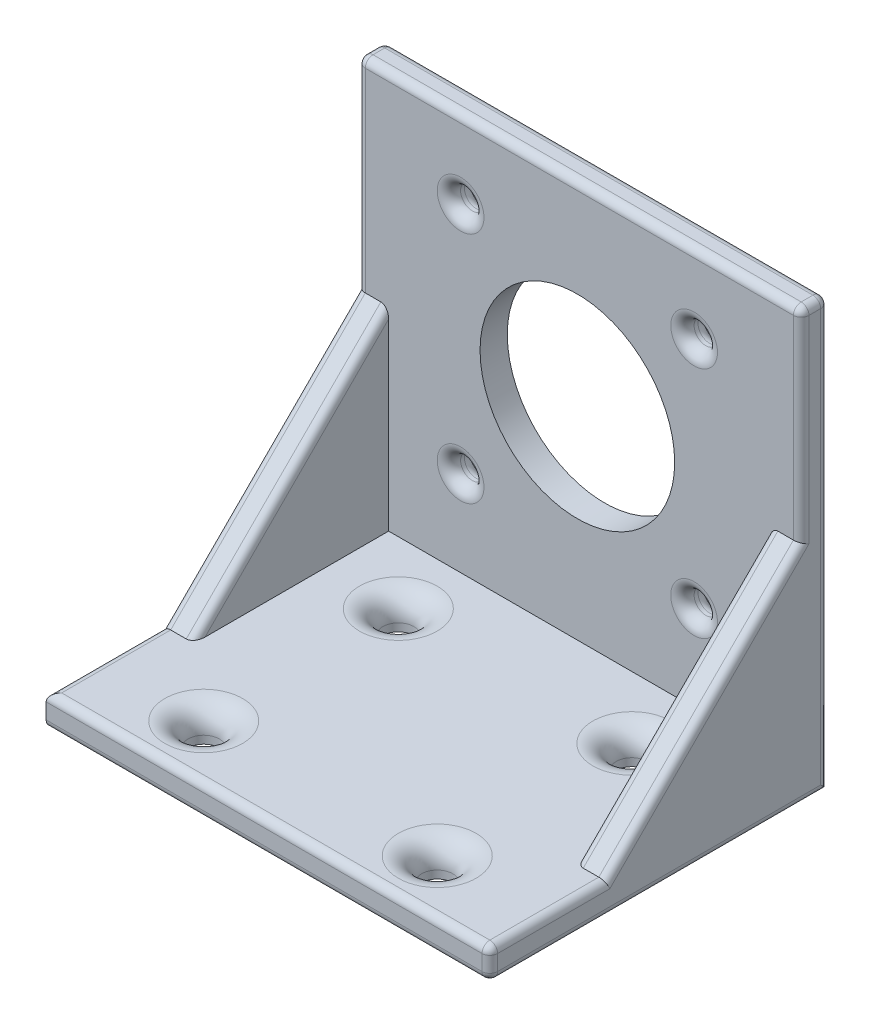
ISO-10303-21;
HEADER;
FILE_DESCRIPTION(('STEP AP214'),'2;1');
FILE_NAME('part.step','',(''),(''),'','','');
FILE_SCHEMA(('AUTOMOTIVE_DESIGN { 1 0 10303 214 1 1 1 1 }'));
ENDSEC;
DATA;
#1=APPLICATION_CONTEXT('core data for automotive mechanical design processes');
#2=APPLICATION_PROTOCOL_DEFINITION('international standard','automotive_design',2000,#1);
#3=PRODUCT_CONTEXT('',#1,'mechanical');
#4=PRODUCT('Part','Part','',(#3));
#5=PRODUCT_RELATED_PRODUCT_CATEGORY('part','',(#4));
#6=PRODUCT_DEFINITION_FORMATION('','',#4);
#7=PRODUCT_DEFINITION_CONTEXT('part definition',#1,'design');
#8=PRODUCT_DEFINITION('design','',#6,#7);
#9=PRODUCT_DEFINITION_SHAPE('','',#8);
#10=(LENGTH_UNIT() NAMED_UNIT(*) SI_UNIT(.MILLI.,.METRE.));
#11=(NAMED_UNIT(*) PLANE_ANGLE_UNIT() SI_UNIT($,.RADIAN.));
#12=(NAMED_UNIT(*) SI_UNIT($,.STERADIAN.) SOLID_ANGLE_UNIT());
#13=UNCERTAINTY_MEASURE_WITH_UNIT(LENGTH_MEASURE(1.E-05),#10,'distance_accuracy_value','');
#14=(GEOMETRIC_REPRESENTATION_CONTEXT(3) GLOBAL_UNCERTAINTY_ASSIGNED_CONTEXT((#13)) GLOBAL_UNIT_ASSIGNED_CONTEXT((#10,
#11,#12)) REPRESENTATION_CONTEXT('',''));
#15=CARTESIAN_POINT('',(0.,0.,0.));
#16=DIRECTION('',(0.,0.,1.));
#17=DIRECTION('',(1.,0.,0.));
#18=AXIS2_PLACEMENT_3D('',#15,#16,#17);
#19=CARTESIAN_POINT('',(0.,0.,3.5));
#20=DIRECTION('',(0.,0.,1.));
#21=DIRECTION('',(1.,0.,0.));
#22=AXIS2_PLACEMENT_3D('',#19,#20,#21);
#23=PLANE('',#22);
#24=CARTESIAN_POINT('',(-22.0243553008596,-30.8309455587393,3.5));
#25=DIRECTION('',(0.,0.,1.));
#26=DIRECTION('',(1.,0.,0.));
#27=AXIS2_PLACEMENT_3D('',#24,#25,#26);
#28=CIRCLE('',#27,3.);
#29=CARTESIAN_POINT('',(-19.0243553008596,-30.8309455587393,3.5));
#30=VERTEX_POINT('',#29);
#31=EDGE_CURVE('E527',#30,#30,#28,.F.);
#32=ORIENTED_EDGE('',*,*,#31,.T.);
#33=EDGE_LOOP('',(#32));
#34=FACE_BOUND('',#33,.T.);
#35=CARTESIAN_POINT('',(-52.0243553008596,-30.8309455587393,3.5));
#36=DIRECTION('',(0.,0.,1.));
#37=DIRECTION('',(1.,0.,0.));
#38=AXIS2_PLACEMENT_3D('',#35,#36,#37);
#39=CIRCLE('',#38,3.);
#40=CARTESIAN_POINT('',(-49.0243553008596,-30.8309455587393,3.5));
#41=VERTEX_POINT('',#40);
#42=EDGE_CURVE('E519',#41,#41,#39,.F.);
#43=ORIENTED_EDGE('',*,*,#42,.T.);
#44=EDGE_LOOP('',(#43));
#45=FACE_BOUND('',#44,.T.);
#46=CARTESIAN_POINT('',(-22.0243553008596,-0.830945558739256,3.5));
#47=DIRECTION('',(0.,0.,1.));
#48=DIRECTION('',(1.,0.,0.));
#49=AXIS2_PLACEMENT_3D('',#46,#47,#48);
#50=CIRCLE('',#49,3.);
#51=CARTESIAN_POINT('',(-19.0243553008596,-0.830945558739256,3.5));
#52=VERTEX_POINT('',#51);
#53=EDGE_CURVE('E487',#52,#52,#50,.F.);
#54=ORIENTED_EDGE('',*,*,#53,.T.);
#55=EDGE_LOOP('',(#54));
#56=FACE_BOUND('',#55,.T.);
#57=CARTESIAN_POINT('',(-52.0243553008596,-0.830945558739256,3.5));
#58=DIRECTION('',(0.,0.,1.));
#59=DIRECTION('',(1.,0.,0.));
#60=AXIS2_PLACEMENT_3D('',#57,#58,#59);
#61=CIRCLE('',#60,3.);
#62=CARTESIAN_POINT('',(-49.0243553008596,-0.830945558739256,3.5));
#63=VERTEX_POINT('',#62);
#64=EDGE_CURVE('E471',#63,#63,#61,.F.);
#65=ORIENTED_EDGE('',*,*,#64,.T.);
#66=EDGE_LOOP('',(#65));
#67=FACE_BOUND('',#66,.T.);
#68=DIRECTION('',(0.,1.,0.));
#69=VECTOR('',#68,1.);
#70=CARTESIAN_POINT('',(-12.2691449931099,-41.8309455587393,3.5));
#71=LINE('',#70,#69);
#72=CARTESIAN_POINT('',(-12.2691449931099,-41.8309455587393,3.5));
#73=VERTEX_POINT('',#72);
#74=CARTESIAN_POINT('',(-12.2691449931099,-18.2451591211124,3.5));
#75=VERTEX_POINT('',#74);
#76=EDGE_CURVE('E198',#73,#75,#71,.T.);
#77=ORIENTED_EDGE('',*,*,#76,.T.);
#78=CARTESIAN_POINT('',(-11.2691449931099,-18.2451591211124,3.5));
#79=DIRECTION('',(0.,0.,1.));
#80=DIRECTION('',(0.,-1.,0.));
#81=AXIS2_PLACEMENT_3D('',#78,#79,#80);
#82=ELLIPSE('',#81,1.4142135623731,1.);
#83=CARTESIAN_POINT('',(-11.2691449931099,-16.8309455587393,3.5));
#84=VERTEX_POINT('',#83);
#85=EDGE_CURVE('E464',#75,#84,#82,.F.);
#86=ORIENTED_EDGE('',*,*,#85,.T.);
#87=DIRECTION('',(1.,0.,0.));
#88=VECTOR('',#87,1.);
#89=CARTESIAN_POINT('',(-12.2691449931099,-16.8309455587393,3.5));
#90=LINE('',#89,#88);
#91=CARTESIAN_POINT('',(-9.26914499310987,-16.8309455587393,3.5));
#92=VERTEX_POINT('',#91);
#93=EDGE_CURVE('E212',#84,#92,#90,.T.);
#94=ORIENTED_EDGE('',*,*,#93,.T.);
#95=DIRECTION('',(0.,1.,0.));
#96=VECTOR('',#95,1.);
#97=CARTESIAN_POINT('',(-9.26914499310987,8.16905444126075,3.5));
#98=LINE('',#97,#96);
#99=CARTESIAN_POINT('',(-9.26914499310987,8.16905444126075,3.5));
#100=VERTEX_POINT('',#99);
#101=EDGE_CURVE('E263',#92,#100,#98,.T.);
#102=ORIENTED_EDGE('',*,*,#101,.T.);
#103=DIRECTION('',(-1.,0.,0.));
#104=VECTOR('',#103,1.);
#105=CARTESIAN_POINT('',(-65.2691449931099,8.16905444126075,3.5));
#106=LINE('',#105,#104);
#107=CARTESIAN_POINT('',(-64.2691449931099,8.16905444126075,3.5));
#108=VERTEX_POINT('',#107);
#109=EDGE_CURVE('E238',#100,#108,#106,.T.);
#110=ORIENTED_EDGE('',*,*,#109,.T.);
#111=DIRECTION('',(0.,-1.,0.));
#112=VECTOR('',#111,1.);
#113=CARTESIAN_POINT('',(-64.2691449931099,-16.8309455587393,3.5));
#114=LINE('',#113,#112);
#115=CARTESIAN_POINT('',(-64.2691449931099,-16.8309455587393,3.5));
#116=VERTEX_POINT('',#115);
#117=EDGE_CURVE('E245',#108,#116,#114,.T.);
#118=ORIENTED_EDGE('',*,*,#117,.T.);
#119=DIRECTION('',(-1.,0.,0.));
#120=VECTOR('',#119,1.);
#121=CARTESIAN_POINT('',(-61.2691449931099,-16.8309455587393,3.5));
#122=LINE('',#121,#120);
#123=CARTESIAN_POINT('',(-62.2691449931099,-16.8309455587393,3.5));
#124=VERTEX_POINT('',#123);
#125=EDGE_CURVE('E770',#124,#116,#122,.T.);
#126=ORIENTED_EDGE('',*,*,#125,.F.);
#127=CARTESIAN_POINT('',(-62.2691449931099,-18.2451591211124,3.5));
#128=DIRECTION('',(0.,0.,1.));
#129=DIRECTION('',(0.,-1.,0.));
#130=AXIS2_PLACEMENT_3D('',#127,#128,#129);
#131=ELLIPSE('',#130,1.4142135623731,1.);
#132=CARTESIAN_POINT('',(-61.2691449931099,-18.2451591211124,3.5));
#133=VERTEX_POINT('',#132);
#134=EDGE_CURVE('E435',#124,#133,#131,.F.);
#135=ORIENTED_EDGE('',*,*,#134,.T.);
#136=DIRECTION('',(0.,-1.,0.));
#137=VECTOR('',#136,1.);
#138=CARTESIAN_POINT('',(-61.2691449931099,-16.8309455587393,3.5));
#139=LINE('',#138,#137);
#140=CARTESIAN_POINT('',(-61.2691449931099,-41.8309455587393,3.5));
#141=VERTEX_POINT('',#140);
#142=EDGE_CURVE('E205',#133,#141,#139,.T.);
#143=ORIENTED_EDGE('',*,*,#142,.T.);
#144=DIRECTION('',(1.,0.,0.));
#145=VECTOR('',#144,1.);
#146=CARTESIAN_POINT('',(-65.2691449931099,-41.8309455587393,3.5));
#147=LINE('',#146,#145);
#148=EDGE_CURVE('E195',#141,#73,#147,.T.);
#149=ORIENTED_EDGE('',*,*,#148,.T.);
#150=EDGE_LOOP('',(#77,#86,#94,#102,#110,#118,#126,#135,#143,#149));
#151=FACE_BOUND('',#150,.T.);
#152=CARTESIAN_POINT('',(-37.0243553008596,-15.8309455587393,3.5));
#153=DIRECTION('',(0.,0.,1.));
#154=DIRECTION('',(1.,0.,0.));
#155=AXIS2_PLACEMENT_3D('',#152,#153,#154);
#156=CIRCLE('',#155,12.5);
#157=CARTESIAN_POINT('',(-24.5243553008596,-15.8309455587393,3.5));
#158=VERTEX_POINT('',#157);
#159=EDGE_CURVE('E224',#158,#158,#156,.T.);
#160=ORIENTED_EDGE('',*,*,#159,.F.);
#161=EDGE_LOOP('',(#160));
#162=FACE_BOUND('',#161,.T.);
#163=ADVANCED_FACE('F41',(#34,#45,#56,#67,#151,#162),#23,.T.);
#164=CARTESIAN_POINT('',(0.,0.,0.));
#165=DIRECTION('',(0.,0.,1.));
#166=DIRECTION('',(1.,0.,0.));
#167=AXIS2_PLACEMENT_3D('',#164,#165,#166);
#168=PLANE('',#167);
#169=CARTESIAN_POINT('',(-52.0243553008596,-30.8309455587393,0.));
#170=DIRECTION('',(0.,0.,1.));
#171=DIRECTION('',(1.,0.,0.));
#172=AXIS2_PLACEMENT_3D('',#169,#170,#171);
#173=CIRCLE('',#172,3.);
#174=CARTESIAN_POINT('',(-49.0243553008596,-30.8309455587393,0.));
#175=VERTEX_POINT('',#174);
#176=EDGE_CURVE('E507',#175,#175,#173,.T.);
#177=ORIENTED_EDGE('',*,*,#176,.T.);
#178=EDGE_LOOP('',(#177));
#179=FACE_BOUND('',#178,.T.);
#180=CARTESIAN_POINT('',(-22.0243553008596,-30.8309455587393,0.));
#181=DIRECTION('',(0.,0.,1.));
#182=DIRECTION('',(1.,0.,0.));
#183=AXIS2_PLACEMENT_3D('',#180,#181,#182);
#184=CIRCLE('',#183,3.);
#185=CARTESIAN_POINT('',(-19.0243553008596,-30.8309455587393,0.));
#186=VERTEX_POINT('',#185);
#187=EDGE_CURVE('E499',#186,#186,#184,.T.);
#188=ORIENTED_EDGE('',*,*,#187,.T.);
#189=EDGE_LOOP('',(#188));
#190=FACE_BOUND('',#189,.T.);
#191=CARTESIAN_POINT('',(-22.0243553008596,-0.830945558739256,0.));
#192=DIRECTION('',(0.,0.,1.));
#193=DIRECTION('',(1.,0.,0.));
#194=AXIS2_PLACEMENT_3D('',#191,#192,#193);
#195=CIRCLE('',#194,3.);
#196=CARTESIAN_POINT('',(-19.0243553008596,-0.830945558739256,0.));
#197=VERTEX_POINT('',#196);
#198=EDGE_CURVE('E491',#197,#197,#195,.T.);
#199=ORIENTED_EDGE('',*,*,#198,.T.);
#200=EDGE_LOOP('',(#199));
#201=FACE_BOUND('',#200,.T.);
#202=CARTESIAN_POINT('',(-52.0243553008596,-0.830945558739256,0.));
#203=DIRECTION('',(0.,0.,1.));
#204=DIRECTION('',(1.,0.,0.));
#205=AXIS2_PLACEMENT_3D('',#202,#203,#204);
#206=CIRCLE('',#205,3.);
#207=CARTESIAN_POINT('',(-49.0243553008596,-0.830945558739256,0.));
#208=VERTEX_POINT('',#207);
#209=EDGE_CURVE('E475',#208,#208,#206,.T.);
#210=ORIENTED_EDGE('',*,*,#209,.T.);
#211=EDGE_LOOP('',(#210));
#212=FACE_BOUND('',#211,.T.);
#213=DIRECTION('',(1.,0.,0.));
#214=VECTOR('',#213,1.);
#215=CARTESIAN_POINT('',(-65.2691449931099,-45.8309455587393,0.));
#216=LINE('',#215,#214);
#217=CARTESIAN_POINT('',(-64.2691449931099,-45.8309455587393,0.));
#218=VERTEX_POINT('',#217);
#219=CARTESIAN_POINT('',(-9.26914499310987,-45.8309455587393,0.));
#220=VERTEX_POINT('',#219);
#221=EDGE_CURVE('E228',#218,#220,#216,.T.);
#222=ORIENTED_EDGE('',*,*,#221,.F.);
#223=DIRECTION('',(0.,-1.,0.));
#224=VECTOR('',#223,1.);
#225=CARTESIAN_POINT('',(-64.2691449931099,0.,0.));
#226=LINE('',#225,#224);
#227=CARTESIAN_POINT('',(-64.2691449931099,8.16905444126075,0.));
#228=VERTEX_POINT('',#227);
#229=EDGE_CURVE('E321',#218,#228,#226,.F.);
#230=ORIENTED_EDGE('',*,*,#229,.T.);
#231=DIRECTION('',(-1.,0.,0.));
#232=VECTOR('',#231,1.);
#233=CARTESIAN_POINT('',(0.,8.16905444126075,0.));
#234=LINE('',#233,#232);
#235=CARTESIAN_POINT('',(-9.26914499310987,8.16905444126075,0.));
#236=VERTEX_POINT('',#235);
#237=EDGE_CURVE('E315',#228,#236,#234,.F.);
#238=ORIENTED_EDGE('',*,*,#237,.T.);
#239=DIRECTION('',(0.,1.,0.));
#240=VECTOR('',#239,1.);
#241=CARTESIAN_POINT('',(-9.26914499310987,0.,0.));
#242=LINE('',#241,#240);
#243=EDGE_CURVE('E318',#236,#220,#242,.F.);
#244=ORIENTED_EDGE('',*,*,#243,.T.);
#245=EDGE_LOOP('',(#222,#230,#238,#244));
#246=FACE_BOUND('',#245,.T.);
#247=CARTESIAN_POINT('',(-37.0243553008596,-15.8309455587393,0.));
#248=DIRECTION('',(0.,0.,1.));
#249=DIRECTION('',(1.,0.,0.));
#250=AXIS2_PLACEMENT_3D('',#247,#248,#249);
#251=CIRCLE('',#250,12.5);
#252=CARTESIAN_POINT('',(-24.5243553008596,-15.8309455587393,0.));
#253=VERTEX_POINT('',#252);
#254=EDGE_CURVE('E207',#253,#253,#251,.T.);
#255=ORIENTED_EDGE('',*,*,#254,.T.);
#256=EDGE_LOOP('',(#255));
#257=FACE_BOUND('',#256,.T.);
#258=ADVANCED_FACE('F571',(#179,#190,#201,#212,#246,#257),#168,.F.);
#259=CARTESIAN_POINT('',(-65.2691449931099,9.16905444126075,3.5));
#260=DIRECTION('',(1.,0.,0.));
#261=DIRECTION('',(0.,0.,-1.));
#262=AXIS2_PLACEMENT_3D('',#259,#260,#261);
#263=PLANE('',#262);
#264=DIRECTION('',(0.,0.,-1.));
#265=VECTOR('',#264,1.);
#266=CARTESIAN_POINT('',(-65.2691449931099,-45.8309455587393,3.5));
#267=LINE('',#266,#265);
#268=CARTESIAN_POINT('',(-65.2691449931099,-45.8309455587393,42.5));
#269=VERTEX_POINT('',#268);
#270=CARTESIAN_POINT('',(-65.2691449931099,-45.8309455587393,1.));
#271=VERTEX_POINT('',#270);
#272=EDGE_CURVE('E235',#269,#271,#267,.T.);
#273=ORIENTED_EDGE('',*,*,#272,.F.);
#274=CARTESIAN_POINT('',(-65.2691449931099,-44.8309455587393,42.5));
#275=DIRECTION('',(1.,0.,0.));
#276=DIRECTION('',(0.,0.,-1.));
#277=AXIS2_PLACEMENT_3D('',#274,#275,#276);
#278=CIRCLE('',#277,1.);
#279=CARTESIAN_POINT('',(-65.2691449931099,-44.8309455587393,43.5));
#280=VERTEX_POINT('',#279);
#281=EDGE_CURVE('E413',#269,#280,#278,.F.);
#282=ORIENTED_EDGE('',*,*,#281,.T.);
#283=DIRECTION('',(0.,-1.,0.));
#284=VECTOR('',#283,1.);
#285=CARTESIAN_POINT('',(-65.2691449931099,-45.8309455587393,43.5));
#286=LINE('',#285,#284);
#287=CARTESIAN_POINT('',(-65.2691449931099,-42.8309455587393,43.5));
#288=VERTEX_POINT('',#287);
#289=EDGE_CURVE('E208',#288,#280,#286,.T.);
#290=ORIENTED_EDGE('',*,*,#289,.F.);
#291=DIRECTION('',(0.,0.,1.));
#292=VECTOR('',#291,1.);
#293=CARTESIAN_POINT('',(-65.2691449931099,-42.8309455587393,28.5));
#294=LINE('',#293,#292);
#295=CARTESIAN_POINT('',(-65.2691449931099,-42.8309455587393,28.0857864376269));
#296=VERTEX_POINT('',#295);
#297=EDGE_CURVE('E410',#288,#296,#294,.F.);
#298=ORIENTED_EDGE('',*,*,#297,.T.);
#299=DIRECTION('',(0.,0.707106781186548,-0.707106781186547));
#300=VECTOR('',#299,1.);
#301=CARTESIAN_POINT('',(-65.2691449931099,-16.5380523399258,1.79289321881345));
#302=LINE('',#301,#300);
#303=CARTESIAN_POINT('',(-65.2691449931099,-17.2451591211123,2.5));
#304=VERTEX_POINT('',#303);
#305=EDGE_CURVE('E406',#296,#304,#302,.T.);
#306=ORIENTED_EDGE('',*,*,#305,.T.);
#307=DIRECTION('',(0.,-1.,0.));
#308=VECTOR('',#307,1.);
#309=CARTESIAN_POINT('',(-65.2691449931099,8.16905444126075,2.5));
#310=LINE('',#309,#308);
#311=CARTESIAN_POINT('',(-65.2691449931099,8.16905444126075,2.5));
#312=VERTEX_POINT('',#311);
#313=EDGE_CURVE('E253',#304,#312,#310,.F.);
#314=ORIENTED_EDGE('',*,*,#313,.T.);
#315=DIRECTION('',(0.,0.,-1.));
#316=VECTOR('',#315,1.);
#317=CARTESIAN_POINT('',(-65.2691449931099,8.16905444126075,3.5));
#318=LINE('',#317,#316);
#319=CARTESIAN_POINT('',(-65.2691449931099,8.16905444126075,1.));
#320=VERTEX_POINT('',#319);
#321=EDGE_CURVE('E249',#312,#320,#318,.T.);
#322=ORIENTED_EDGE('',*,*,#321,.T.);
#323=DIRECTION('',(0.,-1.,0.));
#324=VECTOR('',#323,1.);
#325=CARTESIAN_POINT('',(-65.2691449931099,9.16905444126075,1.));
#326=LINE('',#325,#324);
#327=EDGE_CURVE('E304',#320,#271,#326,.T.);
#328=ORIENTED_EDGE('',*,*,#327,.T.);
#329=EDGE_LOOP('',(#273,#282,#290,#298,#306,#314,#322,#328));
#330=FACE_BOUND('',#329,.T.);
#331=ADVANCED_FACE('F577',(#330),#263,.F.);
#332=CARTESIAN_POINT('',(-65.2691449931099,-45.8309455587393,3.5));
#333=DIRECTION('',(0.,1.,0.));
#334=DIRECTION('',(0.,0.,1.));
#335=AXIS2_PLACEMENT_3D('',#332,#333,#334);
#336=PLANE('',#335);
#337=CARTESIAN_POINT('',(-22.0243553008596,-45.8309455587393,36.5));
#338=DIRECTION('',(0.,1.,0.));
#339=DIRECTION('',(0.,0.,1.));
#340=AXIS2_PLACEMENT_3D('',#337,#338,#339);
#341=CIRCLE('',#340,2.);
#342=CARTESIAN_POINT('',(-22.0243553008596,-45.8309455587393,38.5));
#343=VERTEX_POINT('',#342);
#344=EDGE_CURVE('E761',#343,#343,#341,.T.);
#345=ORIENTED_EDGE('',*,*,#344,.T.);
#346=EDGE_LOOP('',(#345));
#347=FACE_BOUND('',#346,.T.);
#348=CARTESIAN_POINT('',(-52.0243553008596,-45.8309455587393,11.5));
#349=DIRECTION('',(0.,1.,0.));
#350=DIRECTION('',(0.,0.,1.));
#351=AXIS2_PLACEMENT_3D('',#348,#349,#350);
#352=CIRCLE('',#351,2.);
#353=CARTESIAN_POINT('',(-52.0243553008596,-45.8309455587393,13.5));
#354=VERTEX_POINT('',#353);
#355=EDGE_CURVE('E755',#354,#354,#352,.T.);
#356=ORIENTED_EDGE('',*,*,#355,.T.);
#357=EDGE_LOOP('',(#356));
#358=FACE_BOUND('',#357,.T.);
#359=CARTESIAN_POINT('',(-22.0243553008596,-45.8309455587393,11.5));
#360=DIRECTION('',(0.,1.,0.));
#361=DIRECTION('',(0.,0.,1.));
#362=AXIS2_PLACEMENT_3D('',#359,#360,#361);
#363=CIRCLE('',#362,2.);
#364=CARTESIAN_POINT('',(-22.0243553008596,-45.8309455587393,13.5));
#365=VERTEX_POINT('',#364);
#366=EDGE_CURVE('E751',#365,#365,#363,.T.);
#367=ORIENTED_EDGE('',*,*,#366,.T.);
#368=EDGE_LOOP('',(#367));
#369=FACE_BOUND('',#368,.T.);
#370=CARTESIAN_POINT('',(-52.0243553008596,-45.8309455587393,36.5));
#371=DIRECTION('',(0.,1.,0.));
#372=DIRECTION('',(0.,0.,1.));
#373=AXIS2_PLACEMENT_3D('',#370,#371,#372);
#374=CIRCLE('',#373,2.);
#375=CARTESIAN_POINT('',(-52.0243553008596,-45.8309455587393,38.5));
#376=VERTEX_POINT('',#375);
#377=EDGE_CURVE('E273',#376,#376,#374,.T.);
#378=ORIENTED_EDGE('',*,*,#377,.T.);
#379=EDGE_LOOP('',(#378));
#380=FACE_BOUND('',#379,.T.);
#381=DIRECTION('',(0.,0.,-1.));
#382=VECTOR('',#381,1.);
#383=CARTESIAN_POINT('',(-9.26914499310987,-45.8309455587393,3.5));
#384=LINE('',#383,#382);
#385=CARTESIAN_POINT('',(-9.26914499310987,-45.8309455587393,42.5));
#386=VERTEX_POINT('',#385);
#387=EDGE_CURVE('E308',#220,#386,#384,.F.);
#388=ORIENTED_EDGE('',*,*,#387,.T.);
#389=DIRECTION('',(1.,0.,0.));
#390=VECTOR('',#389,1.);
#391=CARTESIAN_POINT('',(-65.2691449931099,-45.8309455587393,42.5));
#392=LINE('',#391,#390);
#393=EDGE_CURVE('E403',#386,#269,#392,.F.);
#394=ORIENTED_EDGE('',*,*,#393,.T.);
#395=ORIENTED_EDGE('',*,*,#272,.T.);
#396=CARTESIAN_POINT('',(-64.2691449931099,-45.8309455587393,1.));
#397=DIRECTION('',(0.,1.,0.));
#398=DIRECTION('',(0.,0.,1.));
#399=AXIS2_PLACEMENT_3D('',#396,#397,#398);
#400=CIRCLE('',#399,1.);
#401=EDGE_CURVE('E312',#271,#218,#400,.F.);
#402=ORIENTED_EDGE('',*,*,#401,.T.);
#403=ORIENTED_EDGE('',*,*,#221,.T.);
#404=EDGE_LOOP('',(#388,#394,#395,#402,#403));
#405=FACE_BOUND('',#404,.T.);
#406=ADVANCED_FACE('F592',(#347,#358,#369,#380,#405),#336,.F.);
#407=CARTESIAN_POINT('',(-8.26914499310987,9.16905444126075,3.5));
#408=DIRECTION('',(-1.,0.,0.));
#409=DIRECTION('',(0.,-1.,0.));
#410=AXIS2_PLACEMENT_3D('',#407,#408,#409);
#411=PLANE('',#410);
#412=DIRECTION('',(0.,-0.707106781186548,0.707106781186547));
#413=VECTOR('',#412,1.);
#414=CARTESIAN_POINT('',(-8.26914499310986,-42.5380523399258,27.7928932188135));
#415=LINE('',#414,#413);
#416=CARTESIAN_POINT('',(-8.26914499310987,-17.2451591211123,2.5));
#417=VERTEX_POINT('',#416);
#418=CARTESIAN_POINT('',(-8.26914499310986,-42.8309455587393,28.0857864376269));
#419=VERTEX_POINT('',#418);
#420=EDGE_CURVE('E294',#417,#419,#415,.T.);
#421=ORIENTED_EDGE('',*,*,#420,.T.);
#422=DIRECTION('',(0.,0.,1.));
#423=VECTOR('',#422,1.);
#424=CARTESIAN_POINT('',(-8.26914499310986,-42.8309455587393,43.5));
#425=LINE('',#424,#423);
#426=CARTESIAN_POINT('',(-8.26914499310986,-42.8309455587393,42.5));
#427=VERTEX_POINT('',#426);
#428=EDGE_CURVE('E297',#419,#427,#425,.T.);
#429=ORIENTED_EDGE('',*,*,#428,.T.);
#430=DIRECTION('',(0.,-1.,0.));
#431=VECTOR('',#430,1.);
#432=CARTESIAN_POINT('',(-8.26914499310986,-45.8309455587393,42.5));
#433=LINE('',#432,#431);
#434=CARTESIAN_POINT('',(-8.26914499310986,-44.8309455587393,42.5));
#435=VERTEX_POINT('',#434);
#436=EDGE_CURVE('E286',#427,#435,#433,.T.);
#437=ORIENTED_EDGE('',*,*,#436,.T.);
#438=DIRECTION('',(0.,0.,-1.));
#439=VECTOR('',#438,1.);
#440=CARTESIAN_POINT('',(-8.26914499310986,-44.8309455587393,3.5));
#441=LINE('',#440,#439);
#442=CARTESIAN_POINT('',(-8.26914499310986,-44.8309455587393,1.));
#443=VERTEX_POINT('',#442);
#444=EDGE_CURVE('E283',#435,#443,#441,.T.);
#445=ORIENTED_EDGE('',*,*,#444,.T.);
#446=DIRECTION('',(0.,1.,0.));
#447=VECTOR('',#446,1.);
#448=CARTESIAN_POINT('',(-8.26914499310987,9.16905444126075,1.));
#449=LINE('',#448,#447);
#450=CARTESIAN_POINT('',(-8.26914499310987,8.16905444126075,1.));
#451=VERTEX_POINT('',#450);
#452=EDGE_CURVE('E280',#443,#451,#449,.T.);
#453=ORIENTED_EDGE('',*,*,#452,.T.);
#454=DIRECTION('',(0.,0.,-1.));
#455=VECTOR('',#454,1.);
#456=CARTESIAN_POINT('',(-8.26914499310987,8.16905444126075,3.5));
#457=LINE('',#456,#455);
#458=CARTESIAN_POINT('',(-8.26914499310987,8.16905444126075,2.5));
#459=VERTEX_POINT('',#458);
#460=EDGE_CURVE('E277',#451,#459,#457,.F.);
#461=ORIENTED_EDGE('',*,*,#460,.T.);
#462=DIRECTION('',(0.,1.,0.));
#463=VECTOR('',#462,1.);
#464=CARTESIAN_POINT('',(-8.26914499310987,-16.8309455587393,2.5));
#465=LINE('',#464,#463);
#466=EDGE_CURVE('E290',#459,#417,#465,.F.);
#467=ORIENTED_EDGE('',*,*,#466,.T.);
#468=EDGE_LOOP('',(#421,#429,#437,#445,#453,#461,#467));
#469=FACE_BOUND('',#468,.T.);
#470=ADVANCED_FACE('F588',(#469),#411,.F.);
#471=CARTESIAN_POINT('',(-65.2691449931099,9.16905444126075,3.5));
#472=DIRECTION('',(0.,-1.,0.));
#473=DIRECTION('',(1.,0.,0.));
#474=AXIS2_PLACEMENT_3D('',#471,#472,#473);
#475=PLANE('',#474);
#476=DIRECTION('',(-1.,0.,0.));
#477=VECTOR('',#476,1.);
#478=CARTESIAN_POINT('',(-8.26914499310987,9.16905444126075,2.5));
#479=LINE('',#478,#477);
#480=CARTESIAN_POINT('',(-64.2691449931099,9.16905444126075,2.5));
#481=VERTEX_POINT('',#480);
#482=CARTESIAN_POINT('',(-9.26914499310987,9.16905444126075,2.5));
#483=VERTEX_POINT('',#482);
#484=EDGE_CURVE('E241',#481,#483,#479,.F.);
#485=ORIENTED_EDGE('',*,*,#484,.T.);
#486=DIRECTION('',(0.,0.,-1.));
#487=VECTOR('',#486,1.);
#488=CARTESIAN_POINT('',(-9.26914499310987,9.16905444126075,3.5));
#489=LINE('',#488,#487);
#490=CARTESIAN_POINT('',(-9.26914499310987,9.16905444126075,1.));
#491=VERTEX_POINT('',#490);
#492=EDGE_CURVE('E342',#483,#491,#489,.T.);
#493=ORIENTED_EDGE('',*,*,#492,.T.);
#494=DIRECTION('',(-1.,0.,0.));
#495=VECTOR('',#494,1.);
#496=CARTESIAN_POINT('',(-65.2691449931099,9.16905444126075,1.));
#497=LINE('',#496,#495);
#498=CARTESIAN_POINT('',(-64.2691449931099,9.16905444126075,1.));
#499=VERTEX_POINT('',#498);
#500=EDGE_CURVE('E339',#491,#499,#497,.T.);
#501=ORIENTED_EDGE('',*,*,#500,.T.);
#502=DIRECTION('',(0.,0.,-1.));
#503=VECTOR('',#502,1.);
#504=CARTESIAN_POINT('',(-64.2691449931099,9.16905444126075,3.5));
#505=LINE('',#504,#503);
#506=EDGE_CURVE('E260',#499,#481,#505,.F.);
#507=ORIENTED_EDGE('',*,*,#506,.T.);
#508=EDGE_LOOP('',(#485,#493,#501,#507));
#509=FACE_BOUND('',#508,.T.);
#510=ADVANCED_FACE('F585',(#509),#475,.F.);
#511=CARTESIAN_POINT('',(-37.0243553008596,-15.8309455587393,3.5));
#512=DIRECTION('',(0.,0.,-1.));
#513=DIRECTION('',(-1.,0.,0.));
#514=AXIS2_PLACEMENT_3D('',#511,#512,#513);
#515=CYLINDRICAL_SURFACE('',#514,12.5);
#516=ORIENTED_EDGE('',*,*,#159,.T.);
#517=EDGE_LOOP('',(#516));
#518=FACE_BOUND('',#517,.T.);
#519=ORIENTED_EDGE('',*,*,#254,.F.);
#520=EDGE_LOOP('',(#519));
#521=FACE_BOUND('',#520,.T.);
#522=ADVANCED_FACE('F582',(#518,#521),#515,.F.);
#523=CARTESIAN_POINT('',(-22.0243553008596,-0.830945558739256,3.5));
#524=DIRECTION('',(0.,0.,-1.));
#525=DIRECTION('',(-1.,0.,0.));
#526=AXIS2_PLACEMENT_3D('',#523,#524,#525);
#527=CYLINDRICAL_SURFACE('',#526,1.5);
#528=CARTESIAN_POINT('',(-22.0243553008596,-0.830945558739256,1.5));
#529=DIRECTION('',(0.,0.,1.));
#530=DIRECTION('',(1.,0.,0.));
#531=AXIS2_PLACEMENT_3D('',#528,#529,#530);
#532=CIRCLE('',#531,1.5);
#533=CARTESIAN_POINT('',(-20.5243553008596,-0.830945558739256,1.5));
#534=VERTEX_POINT('',#533);
#535=EDGE_CURVE('E495',#534,#534,#532,.F.);
#536=ORIENTED_EDGE('',*,*,#535,.T.);
#537=EDGE_LOOP('',(#536));
#538=FACE_BOUND('',#537,.T.);
#539=CARTESIAN_POINT('',(-22.0243553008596,-0.830945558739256,2.));
#540=DIRECTION('',(0.,0.,1.));
#541=DIRECTION('',(1.,0.,0.));
#542=AXIS2_PLACEMENT_3D('',#539,#540,#541);
#543=CIRCLE('',#542,1.5);
#544=CARTESIAN_POINT('',(-20.5243553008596,-0.830945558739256,2.));
#545=VERTEX_POINT('',#544);
#546=EDGE_CURVE('E483',#545,#545,#543,.T.);
#547=ORIENTED_EDGE('',*,*,#546,.T.);
#548=EDGE_LOOP('',(#547));
#549=FACE_BOUND('',#548,.T.);
#550=ADVANCED_FACE('F824',(#538,#549),#527,.F.);
#551=CARTESIAN_POINT('',(-52.0243553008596,-0.830945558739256,3.5));
#552=DIRECTION('',(0.,0.,-1.));
#553=DIRECTION('',(-1.,0.,0.));
#554=AXIS2_PLACEMENT_3D('',#551,#552,#553);
#555=CYLINDRICAL_SURFACE('',#554,1.5);
#556=CARTESIAN_POINT('',(-52.0243553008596,-0.830945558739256,1.5));
#557=DIRECTION('',(0.,0.,1.));
#558=DIRECTION('',(1.,0.,0.));
#559=AXIS2_PLACEMENT_3D('',#556,#557,#558);
#560=CIRCLE('',#559,1.5);
#561=CARTESIAN_POINT('',(-50.5243553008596,-0.830945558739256,1.5));
#562=VERTEX_POINT('',#561);
#563=EDGE_CURVE('E479',#562,#562,#560,.F.);
#564=ORIENTED_EDGE('',*,*,#563,.T.);
#565=EDGE_LOOP('',(#564));
#566=FACE_BOUND('',#565,.T.);
#567=CARTESIAN_POINT('',(-52.0243553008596,-0.830945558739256,2.));
#568=DIRECTION('',(0.,0.,1.));
#569=DIRECTION('',(1.,0.,0.));
#570=AXIS2_PLACEMENT_3D('',#567,#568,#569);
#571=CIRCLE('',#570,1.5);
#572=CARTESIAN_POINT('',(-50.5243553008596,-0.830945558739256,2.));
#573=VERTEX_POINT('',#572);
#574=EDGE_CURVE('E467',#573,#573,#571,.T.);
#575=ORIENTED_EDGE('',*,*,#574,.T.);
#576=EDGE_LOOP('',(#575));
#577=FACE_BOUND('',#576,.T.);
#578=ADVANCED_FACE('F821',(#566,#577),#555,.F.);
#579=CARTESIAN_POINT('',(-22.0243553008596,-30.8309455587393,3.5));
#580=DIRECTION('',(0.,0.,-1.));
#581=DIRECTION('',(-1.,0.,0.));
#582=AXIS2_PLACEMENT_3D('',#579,#580,#581);
#583=CYLINDRICAL_SURFACE('',#582,1.5);
#584=CARTESIAN_POINT('',(-22.0243553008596,-30.8309455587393,2.));
#585=DIRECTION('',(0.,0.,1.));
#586=DIRECTION('',(1.,0.,0.));
#587=AXIS2_PLACEMENT_3D('',#584,#585,#586);
#588=CIRCLE('',#587,1.5);
#589=CARTESIAN_POINT('',(-20.5243553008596,-30.8309455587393,2.));
#590=VERTEX_POINT('',#589);
#591=EDGE_CURVE('E523',#590,#590,#588,.T.);
#592=ORIENTED_EDGE('',*,*,#591,.T.);
#593=EDGE_LOOP('',(#592));
#594=FACE_BOUND('',#593,.T.);
#595=CARTESIAN_POINT('',(-22.0243553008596,-30.8309455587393,1.5));
#596=DIRECTION('',(0.,0.,1.));
#597=DIRECTION('',(1.,0.,0.));
#598=AXIS2_PLACEMENT_3D('',#595,#596,#597);
#599=CIRCLE('',#598,1.5);
#600=CARTESIAN_POINT('',(-20.5243553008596,-30.8309455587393,1.5));
#601=VERTEX_POINT('',#600);
#602=EDGE_CURVE('E503',#601,#601,#599,.F.);
#603=ORIENTED_EDGE('',*,*,#602,.T.);
#604=EDGE_LOOP('',(#603));
#605=FACE_BOUND('',#604,.T.);
#606=ADVANCED_FACE('F817',(#594,#605),#583,.F.);
#607=CARTESIAN_POINT('',(-52.0243553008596,-30.8309455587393,3.5));
#608=DIRECTION('',(0.,0.,-1.));
#609=DIRECTION('',(-1.,0.,0.));
#610=AXIS2_PLACEMENT_3D('',#607,#608,#609);
#611=CYLINDRICAL_SURFACE('',#610,1.5);
#612=CARTESIAN_POINT('',(-52.0243553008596,-30.8309455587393,2.));
#613=DIRECTION('',(0.,0.,1.));
#614=DIRECTION('',(1.,0.,0.));
#615=AXIS2_PLACEMENT_3D('',#612,#613,#614);
#616=CIRCLE('',#615,1.5);
#617=CARTESIAN_POINT('',(-50.5243553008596,-30.8309455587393,2.));
#618=VERTEX_POINT('',#617);
#619=EDGE_CURVE('E515',#618,#618,#616,.T.);
#620=ORIENTED_EDGE('',*,*,#619,.T.);
#621=EDGE_LOOP('',(#620));
#622=FACE_BOUND('',#621,.T.);
#623=CARTESIAN_POINT('',(-52.0243553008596,-30.8309455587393,1.5));
#624=DIRECTION('',(0.,0.,1.));
#625=DIRECTION('',(1.,0.,0.));
#626=AXIS2_PLACEMENT_3D('',#623,#624,#625);
#627=CIRCLE('',#626,1.5);
#628=CARTESIAN_POINT('',(-50.5243553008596,-30.8309455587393,1.5));
#629=VERTEX_POINT('',#628);
#630=EDGE_CURVE('E511',#629,#629,#627,.F.);
#631=ORIENTED_EDGE('',*,*,#630,.T.);
#632=EDGE_LOOP('',(#631));
#633=FACE_BOUND('',#632,.T.);
#634=ADVANCED_FACE('F810',(#622,#633),#611,.F.);
#635=CARTESIAN_POINT('',(-65.2691449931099,-45.8309455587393,43.5));
#636=DIRECTION('',(0.,0.,1.));
#637=DIRECTION('',(1.,0.,0.));
#638=AXIS2_PLACEMENT_3D('',#635,#636,#637);
#639=PLANE('',#638);
#640=ORIENTED_EDGE('',*,*,#289,.T.);
#641=DIRECTION('',(1.,0.,0.));
#642=VECTOR('',#641,1.);
#643=CARTESIAN_POINT('',(-9.26914499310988,-44.8309455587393,43.5));
#644=LINE('',#643,#642);
#645=CARTESIAN_POINT('',(-9.26914499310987,-44.8309455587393,43.5));
#646=VERTEX_POINT('',#645);
#647=EDGE_CURVE('E400',#280,#646,#644,.T.);
#648=ORIENTED_EDGE('',*,*,#647,.T.);
#649=DIRECTION('',(0.,-1.,0.));
#650=VECTOR('',#649,1.);
#651=CARTESIAN_POINT('',(-9.26914499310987,-41.8309455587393,43.5));
#652=LINE('',#651,#650);
#653=CARTESIAN_POINT('',(-9.26914499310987,-42.8309455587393,43.5));
#654=VERTEX_POINT('',#653);
#655=EDGE_CURVE('E327',#646,#654,#652,.F.);
#656=ORIENTED_EDGE('',*,*,#655,.T.);
#657=DIRECTION('',(1.,0.,0.));
#658=VECTOR('',#657,1.);
#659=CARTESIAN_POINT('',(-65.2691449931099,-42.8309455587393,43.5));
#660=LINE('',#659,#658);
#661=EDGE_CURVE('E397',#654,#288,#660,.F.);
#662=ORIENTED_EDGE('',*,*,#661,.T.);
#663=EDGE_LOOP('',(#640,#648,#656,#662));
#664=FACE_BOUND('',#663,.T.);
#665=ADVANCED_FACE('F807',(#664),#639,.T.);
#666=CARTESIAN_POINT('',(-65.2691449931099,-41.8309455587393,3.5));
#667=DIRECTION('',(0.,1.,0.));
#668=DIRECTION('',(0.,0.,1.));
#669=AXIS2_PLACEMENT_3D('',#666,#667,#668);
#670=PLANE('',#669);
#671=CARTESIAN_POINT('',(-52.0243553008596,-41.8309455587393,11.5));
#672=DIRECTION('',(0.,1.,0.));
#673=DIRECTION('',(0.,0.,1.));
#674=AXIS2_PLACEMENT_3D('',#671,#672,#673);
#675=CIRCLE('',#674,5.);
#676=CARTESIAN_POINT('',(-52.0243553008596,-41.8309455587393,16.5));
#677=VERTEX_POINT('',#676);
#678=EDGE_CURVE('E11',#677,#677,#675,.F.);
#679=ORIENTED_EDGE('',*,*,#678,.T.);
#680=EDGE_LOOP('',(#679));
#681=FACE_BOUND('',#680,.T.);
#682=CARTESIAN_POINT('',(-52.0243553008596,-41.8309455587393,36.5));
#683=DIRECTION('',(0.,1.,0.));
#684=DIRECTION('',(0.,0.,1.));
#685=AXIS2_PLACEMENT_3D('',#682,#683,#684);
#686=CIRCLE('',#685,5.);
#687=CARTESIAN_POINT('',(-52.0243553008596,-41.8309455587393,41.5));
#688=VERTEX_POINT('',#687);
#689=EDGE_CURVE('E547',#688,#688,#686,.F.);
#690=ORIENTED_EDGE('',*,*,#689,.T.);
#691=EDGE_LOOP('',(#690));
#692=FACE_BOUND('',#691,.T.);
#693=CARTESIAN_POINT('',(-22.0243553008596,-41.8309455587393,36.5));
#694=DIRECTION('',(0.,1.,0.));
#695=DIRECTION('',(0.,0.,1.));
#696=AXIS2_PLACEMENT_3D('',#693,#694,#695);
#697=CIRCLE('',#696,5.);
#698=CARTESIAN_POINT('',(-22.0243553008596,-41.8309455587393,41.5));
#699=VERTEX_POINT('',#698);
#700=EDGE_CURVE('E543',#699,#699,#697,.F.);
#701=ORIENTED_EDGE('',*,*,#700,.T.);
#702=EDGE_LOOP('',(#701));
#703=FACE_BOUND('',#702,.T.);
#704=CARTESIAN_POINT('',(-22.0243553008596,-41.8309455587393,11.5));
#705=DIRECTION('',(0.,1.,0.));
#706=DIRECTION('',(0.,0.,1.));
#707=AXIS2_PLACEMENT_3D('',#704,#705,#706);
#708=CIRCLE('',#707,5.);
#709=CARTESIAN_POINT('',(-22.0243553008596,-41.8309455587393,16.5));
#710=VERTEX_POINT('',#709);
#711=EDGE_CURVE('E535',#710,#710,#708,.F.);
#712=ORIENTED_EDGE('',*,*,#711,.T.);
#713=EDGE_LOOP('',(#712));
#714=FACE_BOUND('',#713,.T.);
#715=DIRECTION('',(-1.,0.,0.));
#716=VECTOR('',#715,1.);
#717=CARTESIAN_POINT('',(-61.2691449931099,-41.8309455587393,28.5));
#718=LINE('',#717,#716);
#719=CARTESIAN_POINT('',(-62.2691449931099,-41.8309455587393,28.5));
#720=VERTEX_POINT('',#719);
#721=CARTESIAN_POINT('',(-64.2691449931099,-41.8309455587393,28.5));
#722=VERTEX_POINT('',#721);
#723=EDGE_CURVE('E199',#720,#722,#718,.T.);
#724=ORIENTED_EDGE('',*,*,#723,.T.);
#725=DIRECTION('',(0.,0.,1.));
#726=VECTOR('',#725,1.);
#727=CARTESIAN_POINT('',(-64.2691449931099,-41.8309455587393,43.5));
#728=LINE('',#727,#726);
#729=CARTESIAN_POINT('',(-64.2691449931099,-41.8309455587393,42.5));
#730=VERTEX_POINT('',#729);
#731=EDGE_CURVE('E419',#722,#730,#728,.T.);
#732=ORIENTED_EDGE('',*,*,#731,.T.);
#733=DIRECTION('',(1.,0.,0.));
#734=VECTOR('',#733,1.);
#735=CARTESIAN_POINT('',(-65.2691449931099,-41.8309455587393,42.5));
#736=LINE('',#735,#734);
#737=CARTESIAN_POINT('',(-9.26914499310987,-41.8309455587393,42.5));
#738=VERTEX_POINT('',#737);
#739=EDGE_CURVE('E416',#730,#738,#736,.T.);
#740=ORIENTED_EDGE('',*,*,#739,.T.);
#741=DIRECTION('',(0.,0.,1.));
#742=VECTOR('',#741,1.);
#743=CARTESIAN_POINT('',(-9.26914499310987,-41.8309455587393,28.5));
#744=LINE('',#743,#742);
#745=CARTESIAN_POINT('',(-9.26914499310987,-41.8309455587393,28.5));
#746=VERTEX_POINT('',#745);
#747=EDGE_CURVE('E331',#738,#746,#744,.F.);
#748=ORIENTED_EDGE('',*,*,#747,.T.);
#749=DIRECTION('',(1.,0.,0.));
#750=VECTOR('',#749,1.);
#751=CARTESIAN_POINT('',(-12.2691449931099,-41.8309455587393,28.5));
#752=LINE('',#751,#750);
#753=CARTESIAN_POINT('',(-11.2691449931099,-41.8309455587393,28.5));
#754=VERTEX_POINT('',#753);
#755=EDGE_CURVE('E215',#754,#746,#752,.T.);
#756=ORIENTED_EDGE('',*,*,#755,.F.);
#757=CARTESIAN_POINT('',(-11.2691449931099,-41.8309455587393,27.0857864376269));
#758=DIRECTION('',(0.,1.,0.));
#759=DIRECTION('',(0.,0.,1.));
#760=AXIS2_PLACEMENT_3D('',#757,#758,#759);
#761=ELLIPSE('',#760,1.4142135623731,1.);
#762=CARTESIAN_POINT('',(-12.2691449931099,-41.8309455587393,27.0857864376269));
#763=VERTEX_POINT('',#762);
#764=EDGE_CURVE('E65',#754,#763,#761,.F.);
#765=ORIENTED_EDGE('',*,*,#764,.T.);
#766=DIRECTION('',(0.,0.,-1.));
#767=VECTOR('',#766,1.);
#768=CARTESIAN_POINT('',(-12.2691449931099,-41.8309455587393,3.5));
#769=LINE('',#768,#767);
#770=EDGE_CURVE('E190',#763,#73,#769,.T.);
#771=ORIENTED_EDGE('',*,*,#770,.T.);
#772=ORIENTED_EDGE('',*,*,#148,.F.);
#773=DIRECTION('',(0.,0.,1.));
#774=VECTOR('',#773,1.);
#775=CARTESIAN_POINT('',(-61.2691449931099,-41.8309455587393,3.5));
#776=LINE('',#775,#774);
#777=CARTESIAN_POINT('',(-61.2691449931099,-41.8309455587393,27.0857864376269));
#778=VERTEX_POINT('',#777);
#779=EDGE_CURVE('E767',#141,#778,#776,.T.);
#780=ORIENTED_EDGE('',*,*,#779,.T.);
#781=CARTESIAN_POINT('',(-62.2691449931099,-41.8309455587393,27.0857864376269));
#782=DIRECTION('',(0.,1.,0.));
#783=DIRECTION('',(0.,0.,1.));
#784=AXIS2_PLACEMENT_3D('',#781,#782,#783);
#785=ELLIPSE('',#784,1.41421356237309,1.);
#786=EDGE_CURVE('E438',#778,#720,#785,.F.);
#787=ORIENTED_EDGE('',*,*,#786,.T.);
#788=EDGE_LOOP('',(#724,#732,#740,#748,#756,#765,#771,#772,#780,#787));
#789=FACE_BOUND('',#788,.T.);
#790=ADVANCED_FACE('F193',(#681,#692,#703,#714,#789),#670,.T.);
#791=CARTESIAN_POINT('',(-12.2691449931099,-41.8309455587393,28.5));
#792=DIRECTION('',(0.,0.707106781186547,0.707106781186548));
#793=DIRECTION('',(0.,-0.707106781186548,0.707106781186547));
#794=AXIS2_PLACEMENT_3D('',#791,#792,#793);
#795=PLANE('',#794);
#796=ORIENTED_EDGE('',*,*,#93,.F.);
#797=DIRECTION('',(0.,-0.707106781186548,0.707106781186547));
#798=VECTOR('',#797,1.);
#799=CARTESIAN_POINT('',(-11.2691449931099,-41.8309455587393,28.5));
#800=LINE('',#799,#798);
#801=EDGE_CURVE('E441',#84,#754,#800,.T.);
#802=ORIENTED_EDGE('',*,*,#801,.T.);
#803=ORIENTED_EDGE('',*,*,#755,.T.);
#804=DIRECTION('',(0.,-0.707106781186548,0.707106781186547));
#805=VECTOR('',#804,1.);
#806=CARTESIAN_POINT('',(-9.26914499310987,-16.8309455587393,3.5));
#807=LINE('',#806,#805);
#808=EDGE_CURVE('E335',#746,#92,#807,.F.);
#809=ORIENTED_EDGE('',*,*,#808,.T.);
#810=EDGE_LOOP('',(#796,#802,#803,#809));
#811=FACE_BOUND('',#810,.T.);
#812=ADVANCED_FACE('F803',(#811),#795,.T.);
#813=CARTESIAN_POINT('',(-12.2691449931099,0.,0.));
#814=DIRECTION('',(-1.,0.,0.));
#815=DIRECTION('',(0.,0.,1.));
#816=AXIS2_PLACEMENT_3D('',#813,#814,#815);
#817=PLANE('',#816);
#818=ORIENTED_EDGE('',*,*,#770,.F.);
#819=DIRECTION('',(0.,-0.707106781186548,0.707106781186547));
#820=VECTOR('',#819,1.);
#821=CARTESIAN_POINT('',(-12.2691449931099,-7.37257956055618,-7.37257956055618));
#822=LINE('',#821,#820);
#823=EDGE_CURVE('E57',#763,#75,#822,.F.);
#824=ORIENTED_EDGE('',*,*,#823,.T.);
#825=ORIENTED_EDGE('',*,*,#76,.F.);
#826=EDGE_LOOP('',(#818,#824,#825));
#827=FACE_BOUND('',#826,.T.);
#828=ADVANCED_FACE('F210',(#827),#817,.T.);
#829=CARTESIAN_POINT('',(-61.2691449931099,-41.8309455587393,28.5));
#830=DIRECTION('',(0.,0.707106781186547,0.707106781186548));
#831=DIRECTION('',(0.,-0.707106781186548,0.707106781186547));
#832=AXIS2_PLACEMENT_3D('',#829,#830,#831);
#833=PLANE('',#832);
#834=ORIENTED_EDGE('',*,*,#125,.T.);
#835=DIRECTION('',(0.,0.707106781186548,-0.707106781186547));
#836=VECTOR('',#835,1.);
#837=CARTESIAN_POINT('',(-64.2691449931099,-41.8309455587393,28.5));
#838=LINE('',#837,#836);
#839=EDGE_CURVE('E426',#116,#722,#838,.F.);
#840=ORIENTED_EDGE('',*,*,#839,.T.);
#841=ORIENTED_EDGE('',*,*,#723,.F.);
#842=DIRECTION('',(0.,0.707106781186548,-0.707106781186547));
#843=VECTOR('',#842,1.);
#844=CARTESIAN_POINT('',(-62.2691449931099,-16.8309455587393,3.49999999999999));
#845=LINE('',#844,#843);
#846=EDGE_CURVE('E422',#720,#124,#845,.T.);
#847=ORIENTED_EDGE('',*,*,#846,.T.);
#848=EDGE_LOOP('',(#834,#840,#841,#847));
#849=FACE_BOUND('',#848,.T.);
#850=ADVANCED_FACE('F776',(#849),#833,.T.);
#851=CARTESIAN_POINT('',(-61.2691449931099,0.,0.));
#852=DIRECTION('',(-1.,0.,0.));
#853=DIRECTION('',(0.,-1.,0.));
#854=AXIS2_PLACEMENT_3D('',#851,#852,#853);
#855=PLANE('',#854);
#856=ORIENTED_EDGE('',*,*,#142,.F.);
#857=DIRECTION('',(0.,0.707106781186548,-0.707106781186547));
#858=VECTOR('',#857,1.);
#859=CARTESIAN_POINT('',(-61.2691449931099,-42.5380523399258,27.7928932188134));
#860=LINE('',#859,#858);
#861=EDGE_CURVE('E429',#133,#778,#860,.F.);
#862=ORIENTED_EDGE('',*,*,#861,.T.);
#863=ORIENTED_EDGE('',*,*,#779,.F.);
#864=EDGE_LOOP('',(#856,#862,#863));
#865=FACE_BOUND('',#864,.T.);
#866=ADVANCED_FACE('F745',(#865),#855,.F.);
#867=CARTESIAN_POINT('',(-52.0243553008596,-55.8309455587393,36.5));
#868=DIRECTION('',(0.,1.,0.));
#869=DIRECTION('',(0.,0.,1.));
#870=AXIS2_PLACEMENT_3D('',#867,#868,#869);
#871=CYLINDRICAL_SURFACE('',#870,2.);
#872=CARTESIAN_POINT('',(-52.0243553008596,-44.8309455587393,36.5));
#873=DIRECTION('',(0.,1.,0.));
#874=DIRECTION('',(0.,0.,1.));
#875=AXIS2_PLACEMENT_3D('',#872,#873,#874);
#876=CIRCLE('',#875,2.);
#877=CARTESIAN_POINT('',(-52.0243553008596,-44.8309455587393,38.5));
#878=VERTEX_POINT('',#877);
#879=EDGE_CURVE('E539',#878,#878,#876,.T.);
#880=ORIENTED_EDGE('',*,*,#879,.T.);
#881=EDGE_LOOP('',(#880));
#882=FACE_BOUND('',#881,.T.);
#883=ORIENTED_EDGE('',*,*,#377,.F.);
#884=EDGE_LOOP('',(#883));
#885=FACE_BOUND('',#884,.T.);
#886=ADVANCED_FACE('F741',(#882,#885),#871,.F.);
#887=CARTESIAN_POINT('',(-22.0243553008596,-55.8309455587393,11.5));
#888=DIRECTION('',(0.,1.,0.));
#889=DIRECTION('',(0.,0.,1.));
#890=AXIS2_PLACEMENT_3D('',#887,#888,#889);
#891=CYLINDRICAL_SURFACE('',#890,2.);
#892=CARTESIAN_POINT('',(-22.0243553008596,-44.8309455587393,11.5));
#893=DIRECTION('',(0.,1.,0.));
#894=DIRECTION('',(0.,0.,1.));
#895=AXIS2_PLACEMENT_3D('',#892,#893,#894);
#896=CIRCLE('',#895,2.);
#897=CARTESIAN_POINT('',(-22.0243553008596,-44.8309455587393,13.5));
#898=VERTEX_POINT('',#897);
#899=EDGE_CURVE('E531',#898,#898,#896,.T.);
#900=ORIENTED_EDGE('',*,*,#899,.T.);
#901=EDGE_LOOP('',(#900));
#902=FACE_BOUND('',#901,.T.);
#903=ORIENTED_EDGE('',*,*,#366,.F.);
#904=EDGE_LOOP('',(#903));
#905=FACE_BOUND('',#904,.T.);
#906=ADVANCED_FACE('F744',(#902,#905),#891,.F.);
#907=CARTESIAN_POINT('',(-52.0243553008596,-55.8309455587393,11.5));
#908=DIRECTION('',(0.,1.,0.));
#909=DIRECTION('',(0.,0.,1.));
#910=AXIS2_PLACEMENT_3D('',#907,#908,#909);
#911=CYLINDRICAL_SURFACE('',#910,2.);
#912=CARTESIAN_POINT('',(-52.0243553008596,-44.8309455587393,11.5));
#913=DIRECTION('',(0.,1.,0.));
#914=DIRECTION('',(0.,0.,1.));
#915=AXIS2_PLACEMENT_3D('',#912,#913,#914);
#916=CIRCLE('',#915,2.);
#917=CARTESIAN_POINT('',(-52.0243553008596,-44.8309455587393,13.5));
#918=VERTEX_POINT('',#917);
#919=EDGE_CURVE('E50',#918,#918,#916,.T.);
#920=ORIENTED_EDGE('',*,*,#919,.T.);
#921=EDGE_LOOP('',(#920));
#922=FACE_BOUND('',#921,.T.);
#923=ORIENTED_EDGE('',*,*,#355,.F.);
#924=EDGE_LOOP('',(#923));
#925=FACE_BOUND('',#924,.T.);
#926=ADVANCED_FACE('F558',(#922,#925),#911,.F.);
#927=CARTESIAN_POINT('',(-22.0243553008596,-55.8309455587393,36.5));
#928=DIRECTION('',(0.,1.,0.));
#929=DIRECTION('',(0.,0.,1.));
#930=AXIS2_PLACEMENT_3D('',#927,#928,#929);
#931=CYLINDRICAL_SURFACE('',#930,2.);
#932=CARTESIAN_POINT('',(-22.0243553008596,-44.8309455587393,36.5));
#933=DIRECTION('',(0.,1.,0.));
#934=DIRECTION('',(0.,0.,1.));
#935=AXIS2_PLACEMENT_3D('',#932,#933,#934);
#936=CIRCLE('',#935,2.);
#937=CARTESIAN_POINT('',(-22.0243553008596,-44.8309455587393,38.5));
#938=VERTEX_POINT('',#937);
#939=EDGE_CURVE('E551',#938,#938,#936,.T.);
#940=ORIENTED_EDGE('',*,*,#939,.T.);
#941=EDGE_LOOP('',(#940));
#942=FACE_BOUND('',#941,.T.);
#943=ORIENTED_EDGE('',*,*,#344,.F.);
#944=EDGE_LOOP('',(#943));
#945=FACE_BOUND('',#944,.T.);
#946=ADVANCED_FACE('F604',(#942,#945),#931,.F.);
#947=CARTESIAN_POINT('',(0.,8.16905444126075,2.5));
#948=DIRECTION('',(1.,0.,0.));
#949=DIRECTION('',(0.,1.,0.));
#950=AXIS2_PLACEMENT_3D('',#947,#948,#949);
#951=CYLINDRICAL_SURFACE('',#950,1.);
#952=ORIENTED_EDGE('',*,*,#109,.F.);
#953=CARTESIAN_POINT('',(-9.26914499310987,8.16905444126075,2.5));
#954=DIRECTION('',(1.,0.,0.));
#955=DIRECTION('',(0.,1.,0.));
#956=AXIS2_PLACEMENT_3D('',#953,#954,#955);
#957=CIRCLE('',#956,1.);
#958=EDGE_CURVE('E301',#100,#483,#957,.F.);
#959=ORIENTED_EDGE('',*,*,#958,.T.);
#960=ORIENTED_EDGE('',*,*,#484,.F.);
#961=CARTESIAN_POINT('',(-64.2691449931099,8.16905444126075,2.5));
#962=DIRECTION('',(1.,0.,0.));
#963=DIRECTION('',(0.,1.,0.));
#964=AXIS2_PLACEMENT_3D('',#961,#962,#963);
#965=CIRCLE('',#964,1.);
#966=EDGE_CURVE('E256',#481,#108,#965,.T.);
#967=ORIENTED_EDGE('',*,*,#966,.T.);
#968=EDGE_LOOP('',(#952,#959,#960,#967));
#969=FACE_BOUND('',#968,.T.);
#970=ADVANCED_FACE('F600',(#969),#951,.T.);
#971=CARTESIAN_POINT('',(-64.2691449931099,8.16905444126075,3.5));
#972=DIRECTION('',(0.,0.,-1.));
#973=DIRECTION('',(-1.,0.,0.));
#974=AXIS2_PLACEMENT_3D('',#971,#972,#973);
#975=CYLINDRICAL_SURFACE('',#974,1.);
#976=ORIENTED_EDGE('',*,*,#506,.F.);
#977=CARTESIAN_POINT('',(-64.2691449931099,8.16905444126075,1.));
#978=DIRECTION('',(0.,0.,-1.));
#979=DIRECTION('',(-1.,0.,0.));
#980=AXIS2_PLACEMENT_3D('',#977,#978,#979);
#981=CIRCLE('',#980,1.);
#982=EDGE_CURVE('E324',#499,#320,#981,.F.);
#983=ORIENTED_EDGE('',*,*,#982,.T.);
#984=ORIENTED_EDGE('',*,*,#321,.F.);
#985=CARTESIAN_POINT('',(-64.2691449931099,8.16905444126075,2.5));
#986=DIRECTION('',(0.,0.,1.));
#987=DIRECTION('',(1.,0.,0.));
#988=AXIS2_PLACEMENT_3D('',#985,#986,#987);
#989=CIRCLE('',#988,1.);
#990=EDGE_CURVE('E268',#481,#312,#989,.T.);
#991=ORIENTED_EDGE('',*,*,#990,.F.);
#992=EDGE_LOOP('',(#976,#983,#984,#991));
#993=FACE_BOUND('',#992,.T.);
#994=ADVANCED_FACE('F603',(#993),#975,.T.);
#995=CARTESIAN_POINT('',(-64.2691449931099,8.16905444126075,2.5));
#996=DIRECTION('',(1.,0.,0.));
#997=DIRECTION('',(0.,0.,-1.));
#998=AXIS2_PLACEMENT_3D('',#995,#996,#997);
#999=SPHERICAL_SURFACE('',#998,1.);
#1000=ORIENTED_EDGE('',*,*,#966,.F.);
#1001=ORIENTED_EDGE('',*,*,#990,.T.);
#1002=CARTESIAN_POINT('',(-64.2691449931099,8.16905444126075,2.5));
#1003=DIRECTION('',(0.,-1.,0.));
#1004=DIRECTION('',(0.,0.,-1.));
#1005=AXIS2_PLACEMENT_3D('',#1002,#1003,#1004);
#1006=CIRCLE('',#1005,1.);
#1007=EDGE_CURVE('E264',#108,#312,#1006,.T.);
#1008=ORIENTED_EDGE('',*,*,#1007,.F.);
#1009=EDGE_LOOP('',(#1000,#1001,#1008));
#1010=FACE_BOUND('',#1009,.T.);
#1011=ADVANCED_FACE('F610',(#1010),#999,.T.);
#1012=CARTESIAN_POINT('',(-64.2691449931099,0.,2.5));
#1013=DIRECTION('',(0.,1.,0.));
#1014=DIRECTION('',(0.,0.,1.));
#1015=AXIS2_PLACEMENT_3D('',#1012,#1013,#1014);
#1016=CYLINDRICAL_SURFACE('',#1015,1.);
#1017=ORIENTED_EDGE('',*,*,#1007,.T.);
#1018=ORIENTED_EDGE('',*,*,#313,.F.);
#1019=CARTESIAN_POINT('',(-64.2691449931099,-17.2451591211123,2.5));
#1020=DIRECTION('',(0.,-0.923879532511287,0.38268343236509));
#1021=DIRECTION('',(0.,0.38268343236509,0.923879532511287));
#1022=AXIS2_PLACEMENT_3D('',#1019,#1020,#1021);
#1023=ELLIPSE('',#1022,1.08239220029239,1.);
#1024=EDGE_CURVE('E432',#304,#116,#1023,.F.);
#1025=ORIENTED_EDGE('',*,*,#1024,.T.);
#1026=ORIENTED_EDGE('',*,*,#117,.F.);
#1027=EDGE_LOOP('',(#1017,#1018,#1025,#1026));
#1028=FACE_BOUND('',#1027,.T.);
#1029=ADVANCED_FACE('F606',(#1028),#1016,.T.);
#1030=CARTESIAN_POINT('',(-64.2691449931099,9.16905444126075,1.));
#1031=DIRECTION('',(0.,-1.,0.));
#1032=DIRECTION('',(0.,0.,-1.));
#1033=AXIS2_PLACEMENT_3D('',#1030,#1031,#1032);
#1034=CYLINDRICAL_SURFACE('',#1033,1.);
#1035=ORIENTED_EDGE('',*,*,#401,.F.);
#1036=ORIENTED_EDGE('',*,*,#327,.F.);
#1037=CARTESIAN_POINT('',(-64.2691449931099,8.16905444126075,1.));
#1038=DIRECTION('',(0.,1.,0.));
#1039=DIRECTION('',(0.,0.,1.));
#1040=AXIS2_PLACEMENT_3D('',#1037,#1038,#1039);
#1041=CIRCLE('',#1040,1.);
#1042=EDGE_CURVE('E269',#228,#320,#1041,.T.);
#1043=ORIENTED_EDGE('',*,*,#1042,.F.);
#1044=ORIENTED_EDGE('',*,*,#229,.F.);
#1045=EDGE_LOOP('',(#1035,#1036,#1043,#1044));
#1046=FACE_BOUND('',#1045,.T.);
#1047=ADVANCED_FACE('F609',(#1046),#1034,.T.);
#1048=CARTESIAN_POINT('',(-64.2691449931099,8.16905444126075,1.));
#1049=DIRECTION('',(0.,0.,1.));
#1050=DIRECTION('',(1.,0.,0.));
#1051=AXIS2_PLACEMENT_3D('',#1048,#1049,#1050);
#1052=SPHERICAL_SURFACE('',#1051,1.);
#1053=ORIENTED_EDGE('',*,*,#1042,.T.);
#1054=ORIENTED_EDGE('',*,*,#982,.F.);
#1055=CARTESIAN_POINT('',(-64.2691449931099,8.16905444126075,1.));
#1056=DIRECTION('',(1.,0.,0.));
#1057=DIRECTION('',(0.,0.,-1.));
#1058=AXIS2_PLACEMENT_3D('',#1055,#1056,#1057);
#1059=CIRCLE('',#1058,1.);
#1060=EDGE_CURVE('E377',#228,#499,#1059,.T.);
#1061=ORIENTED_EDGE('',*,*,#1060,.F.);
#1062=EDGE_LOOP('',(#1053,#1054,#1061));
#1063=FACE_BOUND('',#1062,.T.);
#1064=ADVANCED_FACE('F658',(#1063),#1052,.T.);
#1065=CARTESIAN_POINT('',(-9.26914499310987,-44.8309455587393,3.5));
#1066=DIRECTION('',(0.,0.,-1.));
#1067=DIRECTION('',(-1.,0.,0.));
#1068=AXIS2_PLACEMENT_3D('',#1065,#1066,#1067);
#1069=CYLINDRICAL_SURFACE('',#1068,1.);
#1070=ORIENTED_EDGE('',*,*,#444,.F.);
#1071=CARTESIAN_POINT('',(-9.26914499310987,-44.8309455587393,42.5));
#1072=DIRECTION('',(0.,0.,-1.));
#1073=DIRECTION('',(-1.,0.,0.));
#1074=AXIS2_PLACEMENT_3D('',#1071,#1072,#1073);
#1075=CIRCLE('',#1074,1.);
#1076=EDGE_CURVE('E390',#435,#386,#1075,.T.);
#1077=ORIENTED_EDGE('',*,*,#1076,.T.);
#1078=ORIENTED_EDGE('',*,*,#387,.F.);
#1079=CARTESIAN_POINT('',(-9.26914499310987,-44.8309455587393,1.));
#1080=DIRECTION('',(0.,0.707106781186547,-0.707106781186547));
#1081=DIRECTION('',(0.,0.707106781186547,0.707106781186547));
#1082=AXIS2_PLACEMENT_3D('',#1079,#1080,#1081);
#1083=ELLIPSE('',#1082,1.41421356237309,1.);
#1084=EDGE_CURVE('E373',#443,#220,#1083,.T.);
#1085=ORIENTED_EDGE('',*,*,#1084,.F.);
#1086=EDGE_LOOP('',(#1070,#1077,#1078,#1085));
#1087=FACE_BOUND('',#1086,.T.);
#1088=ADVANCED_FACE('F654',(#1087),#1069,.T.);
#1089=CARTESIAN_POINT('',(-65.2691449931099,8.16905444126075,1.));
#1090=DIRECTION('',(-1.,0.,0.));
#1091=DIRECTION('',(0.,-1.,0.));
#1092=AXIS2_PLACEMENT_3D('',#1089,#1090,#1091);
#1093=CYLINDRICAL_SURFACE('',#1092,1.);
#1094=ORIENTED_EDGE('',*,*,#1060,.T.);
#1095=ORIENTED_EDGE('',*,*,#500,.F.);
#1096=CARTESIAN_POINT('',(-9.26914499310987,8.16905444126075,1.));
#1097=DIRECTION('',(1.,0.,0.));
#1098=DIRECTION('',(0.,0.,-1.));
#1099=AXIS2_PLACEMENT_3D('',#1096,#1097,#1098);
#1100=CIRCLE('',#1099,1.);
#1101=EDGE_CURVE('E369',#236,#491,#1100,.T.);
#1102=ORIENTED_EDGE('',*,*,#1101,.F.);
#1103=ORIENTED_EDGE('',*,*,#237,.F.);
#1104=EDGE_LOOP('',(#1094,#1095,#1102,#1103));
#1105=FACE_BOUND('',#1104,.T.);
#1106=ADVANCED_FACE('F650',(#1105),#1093,.T.);
#1107=CARTESIAN_POINT('',(-9.26914499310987,9.16905444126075,1.));
#1108=DIRECTION('',(0.,1.,0.));
#1109=DIRECTION('',(-1.,0.,0.));
#1110=AXIS2_PLACEMENT_3D('',#1107,#1108,#1109);
#1111=CYLINDRICAL_SURFACE('',#1110,1.);
#1112=ORIENTED_EDGE('',*,*,#1084,.T.);
#1113=ORIENTED_EDGE('',*,*,#243,.F.);
#1114=CARTESIAN_POINT('',(-9.26914499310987,8.16905444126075,1.));
#1115=DIRECTION('',(0.,1.,0.));
#1116=DIRECTION('',(0.,0.,1.));
#1117=AXIS2_PLACEMENT_3D('',#1114,#1115,#1116);
#1118=CIRCLE('',#1117,1.);
#1119=EDGE_CURVE('E365',#451,#236,#1118,.T.);
#1120=ORIENTED_EDGE('',*,*,#1119,.F.);
#1121=ORIENTED_EDGE('',*,*,#452,.F.);
#1122=EDGE_LOOP('',(#1112,#1113,#1120,#1121));
#1123=FACE_BOUND('',#1122,.T.);
#1124=ADVANCED_FACE('F646',(#1123),#1111,.T.);
#1125=CARTESIAN_POINT('',(-9.26914499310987,9.16905444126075,42.5));
#1126=DIRECTION('',(0.,1.,0.));
#1127=DIRECTION('',(-1.,0.,0.));
#1128=AXIS2_PLACEMENT_3D('',#1125,#1126,#1127);
#1129=CYLINDRICAL_SURFACE('',#1128,1.);
#1130=ORIENTED_EDGE('',*,*,#655,.F.);
#1131=CARTESIAN_POINT('',(-9.26914499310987,-44.8309455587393,42.5));
#1132=DIRECTION('',(0.,1.,0.));
#1133=DIRECTION('',(-1.,0.,0.));
#1134=AXIS2_PLACEMENT_3D('',#1131,#1132,#1133);
#1135=CIRCLE('',#1134,1.);
#1136=EDGE_CURVE('E386',#646,#435,#1135,.T.);
#1137=ORIENTED_EDGE('',*,*,#1136,.T.);
#1138=ORIENTED_EDGE('',*,*,#436,.F.);
#1139=CARTESIAN_POINT('',(-9.26914499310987,-42.8309455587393,42.5));
#1140=DIRECTION('',(0.,1.,0.));
#1141=DIRECTION('',(-1.,0.,0.));
#1142=AXIS2_PLACEMENT_3D('',#1139,#1140,#1141);
#1143=CIRCLE('',#1142,1.);
#1144=EDGE_CURVE('E345',#427,#654,#1143,.F.);
#1145=ORIENTED_EDGE('',*,*,#1144,.T.);
#1146=EDGE_LOOP('',(#1130,#1137,#1138,#1145));
#1147=FACE_BOUND('',#1146,.T.);
#1148=ADVANCED_FACE('F642',(#1147),#1129,.T.);
#1149=CARTESIAN_POINT('',(-9.26914499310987,8.16905444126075,1.));
#1150=DIRECTION('',(0.,0.,1.));
#1151=DIRECTION('',(1.,0.,0.));
#1152=AXIS2_PLACEMENT_3D('',#1149,#1150,#1151);
#1153=SPHERICAL_SURFACE('',#1152,1.);
#1154=ORIENTED_EDGE('',*,*,#1119,.T.);
#1155=ORIENTED_EDGE('',*,*,#1101,.T.);
#1156=CARTESIAN_POINT('',(-9.26914499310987,8.16905444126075,1.));
#1157=DIRECTION('',(0.,0.,-1.));
#1158=DIRECTION('',(-1.,0.,0.));
#1159=AXIS2_PLACEMENT_3D('',#1156,#1157,#1158);
#1160=CIRCLE('',#1159,1.);
#1161=EDGE_CURVE('E361',#451,#491,#1160,.F.);
#1162=ORIENTED_EDGE('',*,*,#1161,.F.);
#1163=EDGE_LOOP('',(#1154,#1155,#1162));
#1164=FACE_BOUND('',#1163,.T.);
#1165=ADVANCED_FACE('F638',(#1164),#1153,.T.);
#1166=CARTESIAN_POINT('',(-9.26914499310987,-42.8309455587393,3.49999999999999));
#1167=DIRECTION('',(0.,0.,-1.));
#1168=DIRECTION('',(0.,1.,0.));
#1169=AXIS2_PLACEMENT_3D('',#1166,#1167,#1168);
#1170=CYLINDRICAL_SURFACE('',#1169,1.);
#1171=ORIENTED_EDGE('',*,*,#747,.F.);
#1172=CARTESIAN_POINT('',(-9.26914499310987,-42.8309455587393,42.5));
#1173=DIRECTION('',(0.,0.,-1.));
#1174=DIRECTION('',(0.,1.,0.));
#1175=AXIS2_PLACEMENT_3D('',#1172,#1173,#1174);
#1176=CIRCLE('',#1175,1.);
#1177=EDGE_CURVE('E393',#738,#427,#1176,.T.);
#1178=ORIENTED_EDGE('',*,*,#1177,.T.);
#1179=ORIENTED_EDGE('',*,*,#428,.F.);
#1180=CARTESIAN_POINT('',(-9.26914499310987,-42.8309455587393,28.0857864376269));
#1181=DIRECTION('',(0.,0.38268343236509,-0.923879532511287));
#1182=DIRECTION('',(0.,-0.923879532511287,-0.38268343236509));
#1183=AXIS2_PLACEMENT_3D('',#1180,#1181,#1182);
#1184=ELLIPSE('',#1183,1.08239220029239,1.);
#1185=EDGE_CURVE('E357',#746,#419,#1184,.T.);
#1186=ORIENTED_EDGE('',*,*,#1185,.F.);
#1187=EDGE_LOOP('',(#1171,#1178,#1179,#1186));
#1188=FACE_BOUND('',#1187,.T.);
#1189=ADVANCED_FACE('F634',(#1188),#1170,.T.);
#1190=CARTESIAN_POINT('',(-9.26914499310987,8.16905444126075,3.5));
#1191=DIRECTION('',(0.,0.,-1.));
#1192=DIRECTION('',(-1.,0.,0.));
#1193=AXIS2_PLACEMENT_3D('',#1190,#1191,#1192);
#1194=CYLINDRICAL_SURFACE('',#1193,1.);
#1195=ORIENTED_EDGE('',*,*,#1161,.T.);
#1196=ORIENTED_EDGE('',*,*,#492,.F.);
#1197=CARTESIAN_POINT('',(-9.26914499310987,8.16905444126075,2.5));
#1198=DIRECTION('',(0.,0.,1.));
#1199=DIRECTION('',(1.,0.,0.));
#1200=AXIS2_PLACEMENT_3D('',#1197,#1198,#1199);
#1201=CIRCLE('',#1200,1.);
#1202=EDGE_CURVE('E353',#459,#483,#1201,.T.);
#1203=ORIENTED_EDGE('',*,*,#1202,.F.);
#1204=ORIENTED_EDGE('',*,*,#460,.F.);
#1205=EDGE_LOOP('',(#1195,#1196,#1203,#1204));
#1206=FACE_BOUND('',#1205,.T.);
#1207=ADVANCED_FACE('F630',(#1206),#1194,.T.);
#1208=CARTESIAN_POINT('',(-9.26914499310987,-4.5380523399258,-10.2071067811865));
#1209=DIRECTION('',(0.,0.707106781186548,-0.707106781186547));
#1210=DIRECTION('',(0.,0.707106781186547,0.707106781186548));
#1211=AXIS2_PLACEMENT_3D('',#1208,#1209,#1210);
#1212=CYLINDRICAL_SURFACE('',#1211,1.);
#1213=ORIENTED_EDGE('',*,*,#1185,.T.);
#1214=ORIENTED_EDGE('',*,*,#420,.F.);
#1215=CARTESIAN_POINT('',(-9.26914499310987,-17.2451591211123,2.5));
#1216=DIRECTION('',(0.,-0.923879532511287,0.38268343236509));
#1217=DIRECTION('',(0.,-0.38268343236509,-0.923879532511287));
#1218=AXIS2_PLACEMENT_3D('',#1215,#1216,#1217);
#1219=ELLIPSE('',#1218,1.08239220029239,1.);
#1220=EDGE_CURVE('E349',#92,#417,#1219,.F.);
#1221=ORIENTED_EDGE('',*,*,#1220,.F.);
#1222=ORIENTED_EDGE('',*,*,#808,.F.);
#1223=EDGE_LOOP('',(#1213,#1214,#1221,#1222));
#1224=FACE_BOUND('',#1223,.T.);
#1225=ADVANCED_FACE('F626',(#1224),#1212,.T.);
#1226=CARTESIAN_POINT('',(-9.26914499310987,8.16905444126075,2.5));
#1227=DIRECTION('',(-1.,0.,0.));
#1228=DIRECTION('',(0.,-1.,0.));
#1229=AXIS2_PLACEMENT_3D('',#1226,#1227,#1228);
#1230=SPHERICAL_SURFACE('',#1229,1.);
#1231=ORIENTED_EDGE('',*,*,#1202,.T.);
#1232=ORIENTED_EDGE('',*,*,#958,.F.);
#1233=CARTESIAN_POINT('',(-9.26914499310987,8.16905444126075,2.5));
#1234=DIRECTION('',(0.,-1.,0.));
#1235=DIRECTION('',(0.,0.,-1.));
#1236=AXIS2_PLACEMENT_3D('',#1233,#1234,#1235);
#1237=CIRCLE('',#1236,1.);
#1238=EDGE_CURVE('E346',#459,#100,#1237,.T.);
#1239=ORIENTED_EDGE('',*,*,#1238,.F.);
#1240=EDGE_LOOP('',(#1231,#1232,#1239));
#1241=FACE_BOUND('',#1240,.T.);
#1242=ADVANCED_FACE('F622',(#1241),#1230,.T.);
#1243=CARTESIAN_POINT('',(-9.26914499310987,0.,2.5));
#1244=DIRECTION('',(0.,-1.,0.));
#1245=DIRECTION('',(1.,0.,0.));
#1246=AXIS2_PLACEMENT_3D('',#1243,#1244,#1245);
#1247=CYLINDRICAL_SURFACE('',#1246,1.);
#1248=ORIENTED_EDGE('',*,*,#1220,.T.);
#1249=ORIENTED_EDGE('',*,*,#466,.F.);
#1250=ORIENTED_EDGE('',*,*,#1238,.T.);
#1251=ORIENTED_EDGE('',*,*,#101,.F.);
#1252=EDGE_LOOP('',(#1248,#1249,#1250,#1251));
#1253=FACE_BOUND('',#1252,.T.);
#1254=ADVANCED_FACE('F618',(#1253),#1247,.T.);
#1255=CARTESIAN_POINT('',(-65.2691449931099,-44.8309455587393,42.5));
#1256=DIRECTION('',(-1.,0.,0.));
#1257=DIRECTION('',(0.,0.,1.));
#1258=AXIS2_PLACEMENT_3D('',#1255,#1256,#1257);
#1259=CYLINDRICAL_SURFACE('',#1258,1.);
#1260=ORIENTED_EDGE('',*,*,#281,.F.);
#1261=ORIENTED_EDGE('',*,*,#393,.F.);
#1262=CARTESIAN_POINT('',(-9.26914499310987,-44.8309455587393,42.5));
#1263=DIRECTION('',(1.,0.,0.));
#1264=DIRECTION('',(0.,0.,-1.));
#1265=AXIS2_PLACEMENT_3D('',#1262,#1263,#1264);
#1266=CIRCLE('',#1265,1.);
#1267=EDGE_CURVE('E350',#646,#386,#1266,.T.);
#1268=ORIENTED_EDGE('',*,*,#1267,.F.);
#1269=ORIENTED_EDGE('',*,*,#647,.F.);
#1270=EDGE_LOOP('',(#1260,#1261,#1268,#1269));
#1271=FACE_BOUND('',#1270,.T.);
#1272=ADVANCED_FACE('F621',(#1271),#1259,.T.);
#1273=CARTESIAN_POINT('',(-9.26914499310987,-44.8309455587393,42.5));
#1274=DIRECTION('',(0.,0.,1.));
#1275=DIRECTION('',(1.,0.,0.));
#1276=AXIS2_PLACEMENT_3D('',#1273,#1274,#1275);
#1277=SPHERICAL_SURFACE('',#1276,1.);
#1278=ORIENTED_EDGE('',*,*,#1267,.T.);
#1279=ORIENTED_EDGE('',*,*,#1076,.F.);
#1280=ORIENTED_EDGE('',*,*,#1136,.F.);
#1281=EDGE_LOOP('',(#1278,#1279,#1280));
#1282=FACE_BOUND('',#1281,.T.);
#1283=ADVANCED_FACE('F666',(#1282),#1277,.T.);
#1284=CARTESIAN_POINT('',(-64.2691449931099,-4.53805233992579,-10.2071067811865));
#1285=DIRECTION('',(0.,-0.707106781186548,0.707106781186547));
#1286=DIRECTION('',(0.,-0.707106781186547,-0.707106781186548));
#1287=AXIS2_PLACEMENT_3D('',#1284,#1285,#1286);
#1288=CYLINDRICAL_SURFACE('',#1287,1.);
#1289=ORIENTED_EDGE('',*,*,#1024,.F.);
#1290=ORIENTED_EDGE('',*,*,#305,.F.);
#1291=CARTESIAN_POINT('',(-64.2691449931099,-42.8309455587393,28.0857864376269));
#1292=DIRECTION('',(0.,0.38268343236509,-0.923879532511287));
#1293=DIRECTION('',(0.,-0.923879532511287,-0.38268343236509));
#1294=AXIS2_PLACEMENT_3D('',#1291,#1292,#1293);
#1295=ELLIPSE('',#1294,1.08239220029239,1.);
#1296=EDGE_CURVE('E445',#722,#296,#1295,.F.);
#1297=ORIENTED_EDGE('',*,*,#1296,.F.);
#1298=ORIENTED_EDGE('',*,*,#839,.F.);
#1299=EDGE_LOOP('',(#1289,#1290,#1297,#1298));
#1300=FACE_BOUND('',#1299,.T.);
#1301=ADVANCED_FACE('F669',(#1300),#1288,.T.);
#1302=CARTESIAN_POINT('',(-64.2691449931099,-42.8309455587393,3.5));
#1303=DIRECTION('',(0.,0.,-1.));
#1304=DIRECTION('',(0.,1.,0.));
#1305=AXIS2_PLACEMENT_3D('',#1302,#1303,#1304);
#1306=CYLINDRICAL_SURFACE('',#1305,1.);
#1307=ORIENTED_EDGE('',*,*,#1296,.T.);
#1308=ORIENTED_EDGE('',*,*,#297,.F.);
#1309=CARTESIAN_POINT('',(-64.2691449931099,-42.8309455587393,42.5));
#1310=DIRECTION('',(0.707106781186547,0.,0.707106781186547));
#1311=DIRECTION('',(0.707106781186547,0.,-0.707106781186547));
#1312=AXIS2_PLACEMENT_3D('',#1309,#1310,#1311);
#1313=ELLIPSE('',#1312,1.41421356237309,1.);
#1314=EDGE_CURVE('E450',#730,#288,#1313,.T.);
#1315=ORIENTED_EDGE('',*,*,#1314,.F.);
#1316=ORIENTED_EDGE('',*,*,#731,.F.);
#1317=EDGE_LOOP('',(#1307,#1308,#1315,#1316));
#1318=FACE_BOUND('',#1317,.T.);
#1319=ADVANCED_FACE('F682',(#1318),#1306,.T.);
#1320=CARTESIAN_POINT('',(-65.2691449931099,-42.8309455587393,42.5));
#1321=DIRECTION('',(1.,0.,0.));
#1322=DIRECTION('',(0.,0.,-1.));
#1323=AXIS2_PLACEMENT_3D('',#1320,#1321,#1322);
#1324=CYLINDRICAL_SURFACE('',#1323,1.);
#1325=ORIENTED_EDGE('',*,*,#1314,.T.);
#1326=ORIENTED_EDGE('',*,*,#661,.F.);
#1327=CARTESIAN_POINT('',(-9.26914499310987,-42.8309455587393,42.5));
#1328=DIRECTION('',(1.,0.,0.));
#1329=DIRECTION('',(0.,0.,-1.));
#1330=AXIS2_PLACEMENT_3D('',#1327,#1328,#1329);
#1331=CIRCLE('',#1330,1.);
#1332=EDGE_CURVE('E446',#738,#654,#1331,.T.);
#1333=ORIENTED_EDGE('',*,*,#1332,.F.);
#1334=ORIENTED_EDGE('',*,*,#739,.F.);
#1335=EDGE_LOOP('',(#1325,#1326,#1333,#1334));
#1336=FACE_BOUND('',#1335,.T.);
#1337=ADVANCED_FACE('F678',(#1336),#1324,.T.);
#1338=CARTESIAN_POINT('',(-9.26914499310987,-42.8309455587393,42.5));
#1339=DIRECTION('',(0.,0.,1.));
#1340=DIRECTION('',(1.,0.,0.));
#1341=AXIS2_PLACEMENT_3D('',#1338,#1339,#1340);
#1342=SPHERICAL_SURFACE('',#1341,1.);
#1343=ORIENTED_EDGE('',*,*,#1332,.T.);
#1344=ORIENTED_EDGE('',*,*,#1144,.F.);
#1345=ORIENTED_EDGE('',*,*,#1177,.F.);
#1346=EDGE_LOOP('',(#1343,#1344,#1345));
#1347=FACE_BOUND('',#1346,.T.);
#1348=ADVANCED_FACE('F674',(#1347),#1342,.T.);
#1349=CARTESIAN_POINT('',(-62.2691449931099,-42.5380523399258,27.7928932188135));
#1350=DIRECTION('',(0.,-0.707106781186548,0.707106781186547));
#1351=DIRECTION('',(0.,-0.707106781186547,-0.707106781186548));
#1352=AXIS2_PLACEMENT_3D('',#1349,#1350,#1351);
#1353=CYLINDRICAL_SURFACE('',#1352,1.);
#1354=ORIENTED_EDGE('',*,*,#786,.F.);
#1355=ORIENTED_EDGE('',*,*,#861,.F.);
#1356=ORIENTED_EDGE('',*,*,#134,.F.);
#1357=ORIENTED_EDGE('',*,*,#846,.F.);
#1358=EDGE_LOOP('',(#1354,#1355,#1356,#1357));
#1359=FACE_BOUND('',#1358,.T.);
#1360=ADVANCED_FACE('F677',(#1359),#1353,.T.);
#1361=CARTESIAN_POINT('',(-11.2691449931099,-42.5380523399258,27.7928932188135));
#1362=DIRECTION('',(0.,-0.707106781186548,0.707106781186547));
#1363=DIRECTION('',(0.,-0.707106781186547,-0.707106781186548));
#1364=AXIS2_PLACEMENT_3D('',#1361,#1362,#1363);
#1365=CYLINDRICAL_SURFACE('',#1364,1.);
#1366=ORIENTED_EDGE('',*,*,#85,.F.);
#1367=ORIENTED_EDGE('',*,*,#823,.F.);
#1368=ORIENTED_EDGE('',*,*,#764,.F.);
#1369=ORIENTED_EDGE('',*,*,#801,.F.);
#1370=EDGE_LOOP('',(#1366,#1367,#1368,#1369));
#1371=FACE_BOUND('',#1370,.T.);
#1372=ADVANCED_FACE('F692',(#1371),#1365,.T.);
#1373=CARTESIAN_POINT('',(-52.0243553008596,-0.830945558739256,2.));
#1374=DIRECTION('',(0.,0.,1.));
#1375=DIRECTION('',(1.,0.,0.));
#1376=AXIS2_PLACEMENT_3D('',#1373,#1374,#1375);
#1377=TOROIDAL_SURFACE('',#1376,3.,1.5);
#1378=ORIENTED_EDGE('',*,*,#64,.F.);
#1379=EDGE_LOOP('',(#1378));
#1380=FACE_BOUND('',#1379,.T.);
#1381=ORIENTED_EDGE('',*,*,#574,.F.);
#1382=EDGE_LOOP('',(#1381));
#1383=FACE_BOUND('',#1382,.T.);
#1384=ADVANCED_FACE('F696',(#1380,#1383),#1377,.T.);
#1385=CARTESIAN_POINT('',(-52.0243553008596,-0.830945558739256,1.5));
#1386=DIRECTION('',(0.,0.,1.));
#1387=DIRECTION('',(1.,0.,0.));
#1388=AXIS2_PLACEMENT_3D('',#1385,#1386,#1387);
#1389=TOROIDAL_SURFACE('',#1388,3.,1.5);
#1390=ORIENTED_EDGE('',*,*,#563,.F.);
#1391=EDGE_LOOP('',(#1390));
#1392=FACE_BOUND('',#1391,.T.);
#1393=ORIENTED_EDGE('',*,*,#209,.F.);
#1394=EDGE_LOOP('',(#1393));
#1395=FACE_BOUND('',#1394,.T.);
#1396=ADVANCED_FACE('F700',(#1392,#1395),#1389,.T.);
#1397=CARTESIAN_POINT('',(-22.0243553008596,-0.830945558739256,2.));
#1398=DIRECTION('',(0.,0.,1.));
#1399=DIRECTION('',(1.,0.,0.));
#1400=AXIS2_PLACEMENT_3D('',#1397,#1398,#1399);
#1401=TOROIDAL_SURFACE('',#1400,3.,1.5);
#1402=ORIENTED_EDGE('',*,*,#53,.F.);
#1403=EDGE_LOOP('',(#1402));
#1404=FACE_BOUND('',#1403,.T.);
#1405=ORIENTED_EDGE('',*,*,#546,.F.);
#1406=EDGE_LOOP('',(#1405));
#1407=FACE_BOUND('',#1406,.T.);
#1408=ADVANCED_FACE('F704',(#1404,#1407),#1401,.T.);
#1409=CARTESIAN_POINT('',(-22.0243553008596,-0.830945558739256,1.5));
#1410=DIRECTION('',(0.,0.,1.));
#1411=DIRECTION('',(1.,0.,0.));
#1412=AXIS2_PLACEMENT_3D('',#1409,#1410,#1411);
#1413=TOROIDAL_SURFACE('',#1412,3.,1.5);
#1414=ORIENTED_EDGE('',*,*,#535,.F.);
#1415=EDGE_LOOP('',(#1414));
#1416=FACE_BOUND('',#1415,.T.);
#1417=ORIENTED_EDGE('',*,*,#198,.F.);
#1418=EDGE_LOOP('',(#1417));
#1419=FACE_BOUND('',#1418,.T.);
#1420=ADVANCED_FACE('F708',(#1416,#1419),#1413,.T.);
#1421=CARTESIAN_POINT('',(-22.0243553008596,-30.8309455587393,1.5));
#1422=DIRECTION('',(0.,0.,1.));
#1423=DIRECTION('',(1.,0.,0.));
#1424=AXIS2_PLACEMENT_3D('',#1421,#1422,#1423);
#1425=TOROIDAL_SURFACE('',#1424,3.,1.5);
#1426=ORIENTED_EDGE('',*,*,#602,.F.);
#1427=EDGE_LOOP('',(#1426));
#1428=FACE_BOUND('',#1427,.T.);
#1429=ORIENTED_EDGE('',*,*,#187,.F.);
#1430=EDGE_LOOP('',(#1429));
#1431=FACE_BOUND('',#1430,.T.);
#1432=ADVANCED_FACE('F712',(#1428,#1431),#1425,.T.);
#1433=CARTESIAN_POINT('',(-52.0243553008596,-30.8309455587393,1.5));
#1434=DIRECTION('',(0.,0.,1.));
#1435=DIRECTION('',(1.,0.,0.));
#1436=AXIS2_PLACEMENT_3D('',#1433,#1434,#1435);
#1437=TOROIDAL_SURFACE('',#1436,3.,1.5);
#1438=ORIENTED_EDGE('',*,*,#630,.F.);
#1439=EDGE_LOOP('',(#1438));
#1440=FACE_BOUND('',#1439,.T.);
#1441=ORIENTED_EDGE('',*,*,#176,.F.);
#1442=EDGE_LOOP('',(#1441));
#1443=FACE_BOUND('',#1442,.T.);
#1444=ADVANCED_FACE('F716',(#1440,#1443),#1437,.T.);
#1445=CARTESIAN_POINT('',(-52.0243553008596,-30.8309455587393,2.));
#1446=DIRECTION('',(0.,0.,1.));
#1447=DIRECTION('',(1.,0.,0.));
#1448=AXIS2_PLACEMENT_3D('',#1445,#1446,#1447);
#1449=TOROIDAL_SURFACE('',#1448,3.,1.5);
#1450=ORIENTED_EDGE('',*,*,#42,.F.);
#1451=EDGE_LOOP('',(#1450));
#1452=FACE_BOUND('',#1451,.T.);
#1453=ORIENTED_EDGE('',*,*,#619,.F.);
#1454=EDGE_LOOP('',(#1453));
#1455=FACE_BOUND('',#1454,.T.);
#1456=ADVANCED_FACE('F720',(#1452,#1455),#1449,.T.);
#1457=CARTESIAN_POINT('',(-22.0243553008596,-30.8309455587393,2.));
#1458=DIRECTION('',(0.,0.,1.));
#1459=DIRECTION('',(1.,0.,0.));
#1460=AXIS2_PLACEMENT_3D('',#1457,#1458,#1459);
#1461=TOROIDAL_SURFACE('',#1460,3.,1.5);
#1462=ORIENTED_EDGE('',*,*,#31,.F.);
#1463=EDGE_LOOP('',(#1462));
#1464=FACE_BOUND('',#1463,.T.);
#1465=ORIENTED_EDGE('',*,*,#591,.F.);
#1466=EDGE_LOOP('',(#1465));
#1467=FACE_BOUND('',#1466,.T.);
#1468=ADVANCED_FACE('F724',(#1464,#1467),#1461,.T.);
#1469=CARTESIAN_POINT('',(-22.0243553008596,-44.8309455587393,11.5));
#1470=DIRECTION('',(0.,1.,0.));
#1471=DIRECTION('',(0.,0.,1.));
#1472=AXIS2_PLACEMENT_3D('',#1469,#1470,#1471);
#1473=TOROIDAL_SURFACE('',#1472,5.,3.);
#1474=ORIENTED_EDGE('',*,*,#711,.F.);
#1475=EDGE_LOOP('',(#1474));
#1476=FACE_BOUND('',#1475,.T.);
#1477=ORIENTED_EDGE('',*,*,#899,.F.);
#1478=EDGE_LOOP('',(#1477));
#1479=FACE_BOUND('',#1478,.T.);
#1480=ADVANCED_FACE('F728',(#1476,#1479),#1473,.T.);
#1481=CARTESIAN_POINT('',(-52.0243553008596,-44.8309455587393,36.5));
#1482=DIRECTION('',(0.,1.,0.));
#1483=DIRECTION('',(0.,0.,1.));
#1484=AXIS2_PLACEMENT_3D('',#1481,#1482,#1483);
#1485=TOROIDAL_SURFACE('',#1484,5.,3.);
#1486=ORIENTED_EDGE('',*,*,#689,.F.);
#1487=EDGE_LOOP('',(#1486));
#1488=FACE_BOUND('',#1487,.T.);
#1489=ORIENTED_EDGE('',*,*,#879,.F.);
#1490=EDGE_LOOP('',(#1489));
#1491=FACE_BOUND('',#1490,.T.);
#1492=ADVANCED_FACE('F567',(#1488,#1491),#1485,.T.);
#1493=CARTESIAN_POINT('',(-22.0243553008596,-44.8309455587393,36.5));
#1494=DIRECTION('',(0.,1.,0.));
#1495=DIRECTION('',(0.,0.,1.));
#1496=AXIS2_PLACEMENT_3D('',#1493,#1494,#1495);
#1497=TOROIDAL_SURFACE('',#1496,5.,3.);
#1498=ORIENTED_EDGE('',*,*,#700,.F.);
#1499=EDGE_LOOP('',(#1498));
#1500=FACE_BOUND('',#1499,.T.);
#1501=ORIENTED_EDGE('',*,*,#939,.F.);
#1502=EDGE_LOOP('',(#1501));
#1503=FACE_BOUND('',#1502,.T.);
#1504=ADVANCED_FACE('F562',(#1500,#1503),#1497,.T.);
#1505=CARTESIAN_POINT('',(-52.0243553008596,-44.8309455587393,11.5));
#1506=DIRECTION('',(0.,1.,0.));
#1507=DIRECTION('',(0.,0.,1.));
#1508=AXIS2_PLACEMENT_3D('',#1505,#1506,#1507);
#1509=TOROIDAL_SURFACE('',#1508,5.,3.);
#1510=ORIENTED_EDGE('',*,*,#678,.F.);
#1511=EDGE_LOOP('',(#1510));
#1512=FACE_BOUND('',#1511,.T.);
#1513=ORIENTED_EDGE('',*,*,#919,.F.);
#1514=EDGE_LOOP('',(#1513));
#1515=FACE_BOUND('',#1514,.T.);
#1516=ADVANCED_FACE('F43',(#1512,#1515),#1509,.T.);
#1517=CLOSED_SHELL('',(#163,#258,#331,#406,#470,#510,#522,#550,#578,#606,#634,#665,#790,#812,
#828,#850,#866,#886,#906,#926,#946,#970,#994,#1011,#1029,#1047,#1064,#1088,#1106,#1124,#1148,
#1165,#1189,#1207,#1225,#1242,#1254,#1272,#1283,#1301,#1319,#1337,#1348,#1360,#1372,#1384,#1396,
#1408,#1420,#1432,#1444,#1456,#1468,#1480,#1492,#1504,#1516));
#1518=MANIFOLD_SOLID_BREP('B2',#1517);
#1519=ADVANCED_BREP_SHAPE_REPRESENTATION('',(#18,#1518),#14);
#1520=SHAPE_DEFINITION_REPRESENTATION(#9,#1519);
ENDSEC;
END-ISO-10303-21;
